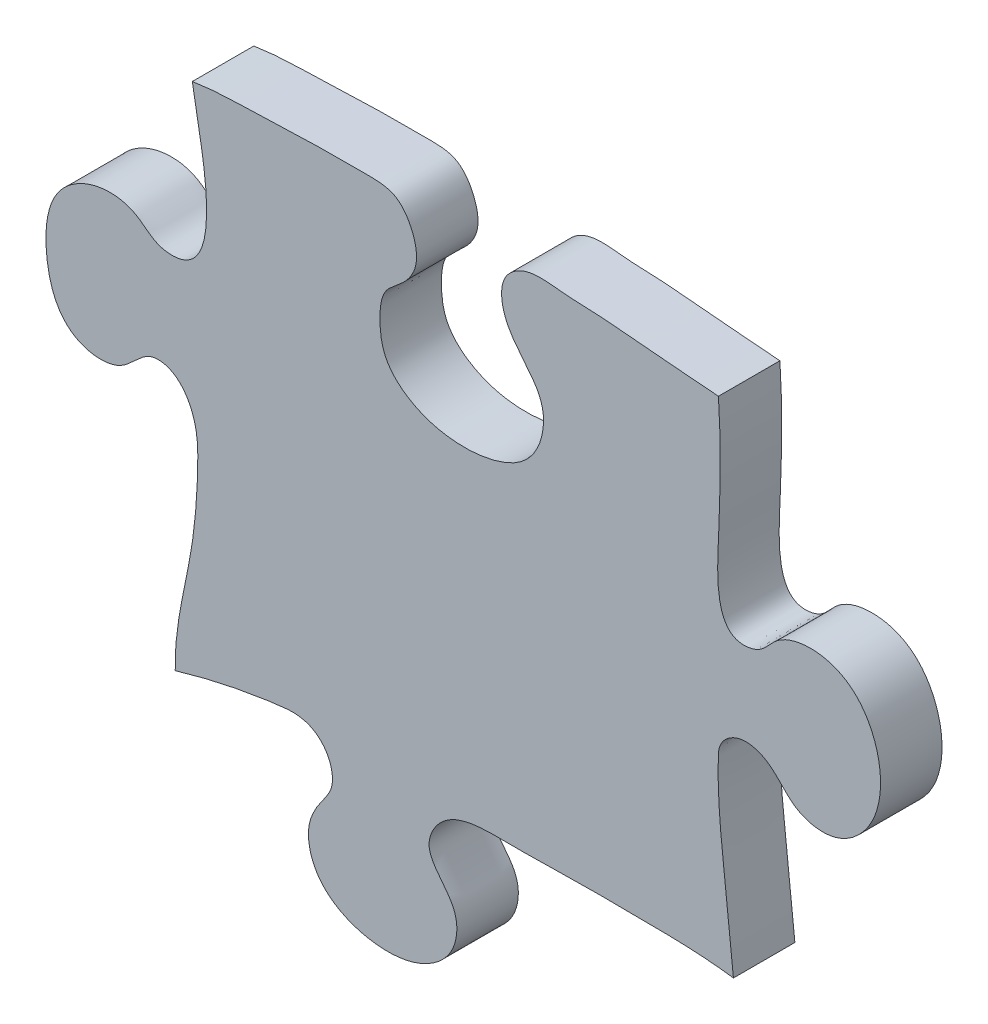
ISO-10303-21;
HEADER;
FILE_DESCRIPTION(('STEP AP214'),'2;1');
FILE_NAME('part.step','',(''),(''),'','','');
FILE_SCHEMA(('AUTOMOTIVE_DESIGN { 1 0 10303 214 1 1 1 1 }'));
ENDSEC;
DATA;
#1=APPLICATION_CONTEXT('core data for automotive mechanical design processes');
#2=APPLICATION_PROTOCOL_DEFINITION('international standard','automotive_design',2000,#1);
#3=PRODUCT_CONTEXT('',#1,'mechanical');
#4=PRODUCT('Part','Part','',(#3));
#5=PRODUCT_RELATED_PRODUCT_CATEGORY('part','',(#4));
#6=PRODUCT_DEFINITION_FORMATION('','',#4);
#7=PRODUCT_DEFINITION_CONTEXT('part definition',#1,'design');
#8=PRODUCT_DEFINITION('design','',#6,#7);
#9=PRODUCT_DEFINITION_SHAPE('','',#8);
#10=(LENGTH_UNIT() NAMED_UNIT(*) SI_UNIT(.MILLI.,.METRE.));
#11=(NAMED_UNIT(*) PLANE_ANGLE_UNIT() SI_UNIT($,.RADIAN.));
#12=(NAMED_UNIT(*) SI_UNIT($,.STERADIAN.) SOLID_ANGLE_UNIT());
#13=UNCERTAINTY_MEASURE_WITH_UNIT(LENGTH_MEASURE(1.E-05),#10,'distance_accuracy_value','');
#14=(GEOMETRIC_REPRESENTATION_CONTEXT(3) GLOBAL_UNCERTAINTY_ASSIGNED_CONTEXT((#13)) GLOBAL_UNIT_ASSIGNED_CONTEXT((#10,
#11,#12)) REPRESENTATION_CONTEXT('',''));
#15=CARTESIAN_POINT('',(0.,0.,0.));
#16=DIRECTION('',(0.,0.,1.));
#17=DIRECTION('',(1.,0.,0.));
#18=AXIS2_PLACEMENT_3D('',#15,#16,#17);
#19=CARTESIAN_POINT('',(164.700455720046,356.,-0.00999999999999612));
#20=CARTESIAN_POINT('',(166.684488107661,335.198470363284,-0.00999999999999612));
#21=CARTESIAN_POINT('',(165.501961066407,316.54844325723,-0.00999999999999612));
#22=CARTESIAN_POINT('',(164.960386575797,287.97241381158,-0.00999999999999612));
#23=CARTESIAN_POINT('',(152.647306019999,285.390744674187,-0.00999999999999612));
#24=CARTESIAN_POINT('',(146.755099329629,295.454986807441,-0.00999999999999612));
#25=CARTESIAN_POINT('',(133.057911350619,298.241097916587,-0.00999999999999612));
#26=CARTESIAN_POINT('',(118.543117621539,289.096389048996,-0.00999999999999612));
#27=CARTESIAN_POINT('',(110.066069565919,270.786201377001,-0.00999999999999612));
#28=CARTESIAN_POINT('',(115.81886117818,249.01949577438,-0.00999999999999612));
#29=CARTESIAN_POINT('',(132.43055469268,243.861484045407,-0.00999999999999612));
#30=CARTESIAN_POINT('',(145.190771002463,247.721589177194,-0.00999999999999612));
#31=CARTESIAN_POINT('',(150.073688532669,259.755128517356,-0.00999999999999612));
#32=CARTESIAN_POINT('',(164.873456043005,258.011209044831,-0.00999999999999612));
#33=CARTESIAN_POINT('',(166.852874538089,244.914449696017,-0.00999999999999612));
#34=CARTESIAN_POINT('',(165.64887314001,235.496089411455,-0.00999999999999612));
#35=CARTESIAN_POINT('',(164.287273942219,218.693357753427,-0.00999999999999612));
#36=CARTESIAN_POINT('',(162.190296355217,197.368034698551,-0.00999999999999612));
#37=CARTESIAN_POINT('',(156.3242571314,163.987545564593,-0.00999999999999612));
#38=CARTESIAN_POINT('',(154.411282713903,133.17643128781,-0.00999999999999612));
#39=CARTESIAN_POINT('',(156.534624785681,107.79955112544,-0.00999999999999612));
#40=CARTESIAN_POINT('',(165.683431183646,96.7362595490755,-0.00999999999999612));
#41=CARTESIAN_POINT('',(175.741034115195,97.7165246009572,-0.00999999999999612));
#42=CARTESIAN_POINT('',(178.913476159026,105.433342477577,-0.00999999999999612));
#43=CARTESIAN_POINT('',(187.788546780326,107.088038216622,-0.00999999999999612));
#44=CARTESIAN_POINT('',(196.945345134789,104.662624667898,-0.00999999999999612));
#45=CARTESIAN_POINT('',(205.29981235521,92.5405980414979,-0.00999999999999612));
#46=CARTESIAN_POINT('',(205.41693478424,76.2178133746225,-0.00999999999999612));
#47=CARTESIAN_POINT('',(199.239540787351,59.8870096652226,-0.00999999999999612));
#48=CARTESIAN_POINT('',(186.871281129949,54.774238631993,-0.00999999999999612));
#49=CARTESIAN_POINT('',(176.156697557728,56.844920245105,-0.00999999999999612));
#50=CARTESIAN_POINT('',(170.099360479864,65.2771221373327,-0.00999999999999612));
#51=CARTESIAN_POINT('',(157.970826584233,62.7514417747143,-0.00999999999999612));
#52=CARTESIAN_POINT('',(154.504441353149,46.6972732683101,-0.00999999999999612));
#53=CARTESIAN_POINT('',(156.826886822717,28.5222575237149,-0.00999999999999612));
#54=CARTESIAN_POINT('',(160.951813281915,-0.904965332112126,-0.00999999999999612));
#55=CARTESIAN_POINT('',(160.817443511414,-23.2712614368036,-0.00999999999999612));
#56=CARTESIAN_POINT('',(159.515162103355,-48.5242453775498,-0.00999999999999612));
#57=CARTESIAN_POINT('',(159.855435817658,-66.2012023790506,-0.00999999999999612));
#58=CARTESIAN_POINT('',(174.098925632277,-64.1326131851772,-0.00999999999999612));
#59=CARTESIAN_POINT('',(178.558905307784,-57.1982656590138,-0.00999999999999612));
#60=CARTESIAN_POINT('',(189.170801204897,-53.4758485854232,-0.00999999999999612));
#61=CARTESIAN_POINT('',(204.121791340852,-56.9229006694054,-0.00999999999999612));
#62=CARTESIAN_POINT('',(214.382314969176,-74.3254117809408,-0.00999999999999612));
#63=CARTESIAN_POINT('',(212.434433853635,-94.56819618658,-0.00999999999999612));
#64=CARTESIAN_POINT('',(198.400882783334,-105.927100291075,-0.00999999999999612));
#65=CARTESIAN_POINT('',(183.864051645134,-103.318484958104,-0.00999999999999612));
#66=CARTESIAN_POINT('',(177.484460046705,-92.9196706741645,-0.00999999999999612));
#67=CARTESIAN_POINT('',(166.612136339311,-90.3684772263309,-0.00999999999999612));
#68=CARTESIAN_POINT('',(160.072685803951,-95.573386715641,-0.00999999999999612));
#69=CARTESIAN_POINT('',(159.605088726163,-111.518801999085,-0.00999999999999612));
#70=CARTESIAN_POINT('',(161.971531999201,-132.152629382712,-0.00999999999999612));
#71=CARTESIAN_POINT('',(165.531009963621,-165.300059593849,-0.00999999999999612));
#72=CARTESIAN_POINT('',(167.927544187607,-195.365052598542,-0.00999999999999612));
#73=CARTESIAN_POINT('',(172.57489134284,-240.687787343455,-0.00999999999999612));
#74=CARTESIAN_POINT('',(151.998880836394,-237.677540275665,-0.00999999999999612));
#75=CARTESIAN_POINT('',(144.556929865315,-230.426442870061,-0.00999999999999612));
#76=CARTESIAN_POINT('',(127.822205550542,-229.966972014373,-0.00999999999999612));
#77=CARTESIAN_POINT('',(119.338975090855,-241.300441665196,-0.00999999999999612));
#78=CARTESIAN_POINT('',(116.55363668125,-259.024274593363,-0.00999999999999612));
#79=CARTESIAN_POINT('',(116.920126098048,-276.665079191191,-0.00999999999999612));
#80=CARTESIAN_POINT('',(139.807593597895,-286.808161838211,-0.00999999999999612));
#81=CARTESIAN_POINT('',(149.426451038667,-271.120437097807,-0.00999999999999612));
#82=CARTESIAN_POINT('',(164.833722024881,-276.098774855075,-0.00999999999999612));
#83=CARTESIAN_POINT('',(167.534498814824,-298.611176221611,-0.00999999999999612));
#84=CARTESIAN_POINT('',(167.66539945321,-324.44648435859,-0.00999999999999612));
#85=CARTESIAN_POINT('',(167.206886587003,-345.801767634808,-0.00999999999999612));
#86=CARTESIAN_POINT('',(167.126415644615,-356.,-0.00999999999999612));
#87=B_SPLINE_CURVE_WITH_KNOTS('',3,(#19,#20,#21,#22,#23,#24,#25,#26,#27,#28,#29,#30,#31,#32,#33,
#34,#35,#36,#37,#38,#39,#40,#41,#42,#43,#44,#45,#46,#47,#48,#49,#50,#51,#52,#53,#54,#55,#56,#57,
#58,#59,#60,#61,#62,#63,#64,#65,#66,#67,#68,#69,#70,#71,#72,#73,#74,#75,#76,#77,#78,#79,#80,#81,
#82,#83,#84,#85,#86),.UNSPECIFIED.,.F.,.F.,(4,1,1,1,1,1,1,1,1,1,1,1,1,1,1,1,1,1,1,1,1,1,1,1,1,1,
1,1,1,1,1,1,1,1,1,1,1,1,1,1,1,1,1,1,1,1,1,1,1,1,1,1,1,1,1,1,1,1,1,1,1,1,1,1,1,4),(0.,
0.0528861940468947,0.0611638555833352,0.0696733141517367,0.078438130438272,0.090018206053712,
0.103675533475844,0.122333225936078,0.142560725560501,0.155895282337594,0.165515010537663,
0.176439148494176,0.187171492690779,0.194785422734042,0.209132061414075,0.213814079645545,
0.241605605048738,0.267229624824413,0.306753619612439,0.326390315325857,0.335466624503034,
0.342457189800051,0.349640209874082,0.355564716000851,0.365339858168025,0.374043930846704,
0.393709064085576,0.408072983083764,0.418687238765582,0.427525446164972,0.43602306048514,
0.444515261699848,0.454494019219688,0.476412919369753,0.496275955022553,0.534624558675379,
0.541144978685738,0.561480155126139,0.567662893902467,0.574392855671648,0.583113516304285,
0.596680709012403,0.612912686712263,0.634082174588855,0.646626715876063,0.657822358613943,
0.669754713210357,0.678210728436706,0.685129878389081,0.689092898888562,0.71784093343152,
0.747115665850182,0.77522808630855,0.815611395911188,0.819725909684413,0.828398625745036,
0.84335213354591,0.85870373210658,0.863219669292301,0.888511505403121,0.901615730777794,
0.918667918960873,0.92637935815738,0.939283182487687,0.973955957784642,1.),.UNSPECIFIED.);
#88=DIRECTION('',(0.,0.,1.));
#89=VECTOR('',#88,1.);
#90=SURFACE_OF_LINEAR_EXTRUSION('',#87,#89);
#91=CARTESIAN_POINT('',(164.700455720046,356.,20.));
#92=CARTESIAN_POINT('',(166.684488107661,335.198470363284,20.));
#93=CARTESIAN_POINT('',(165.501961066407,316.54844325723,20.));
#94=CARTESIAN_POINT('',(164.960386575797,287.97241381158,20.));
#95=CARTESIAN_POINT('',(152.647306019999,285.390744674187,20.));
#96=CARTESIAN_POINT('',(146.755099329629,295.454986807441,20.));
#97=CARTESIAN_POINT('',(133.057911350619,298.241097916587,20.));
#98=CARTESIAN_POINT('',(118.543117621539,289.096389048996,20.));
#99=CARTESIAN_POINT('',(110.066069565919,270.786201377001,20.));
#100=CARTESIAN_POINT('',(115.81886117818,249.01949577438,20.));
#101=CARTESIAN_POINT('',(132.43055469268,243.861484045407,20.));
#102=CARTESIAN_POINT('',(145.190771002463,247.721589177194,20.));
#103=CARTESIAN_POINT('',(150.073688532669,259.755128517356,20.));
#104=CARTESIAN_POINT('',(164.873456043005,258.011209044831,20.));
#105=CARTESIAN_POINT('',(166.852874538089,244.914449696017,20.));
#106=CARTESIAN_POINT('',(165.64887314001,235.496089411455,20.));
#107=CARTESIAN_POINT('',(164.287273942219,218.693357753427,20.));
#108=CARTESIAN_POINT('',(162.190296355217,197.368034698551,20.));
#109=CARTESIAN_POINT('',(156.3242571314,163.987545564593,20.));
#110=CARTESIAN_POINT('',(154.411282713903,133.17643128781,20.));
#111=CARTESIAN_POINT('',(156.534624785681,107.79955112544,20.));
#112=CARTESIAN_POINT('',(165.683431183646,96.7362595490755,20.));
#113=CARTESIAN_POINT('',(175.741034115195,97.7165246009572,20.));
#114=CARTESIAN_POINT('',(178.913476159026,105.433342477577,20.));
#115=CARTESIAN_POINT('',(187.788546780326,107.088038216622,20.));
#116=CARTESIAN_POINT('',(196.945345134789,104.662624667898,20.));
#117=CARTESIAN_POINT('',(205.29981235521,92.5405980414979,20.));
#118=CARTESIAN_POINT('',(205.41693478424,76.2178133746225,20.));
#119=CARTESIAN_POINT('',(199.239540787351,59.8870096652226,20.));
#120=CARTESIAN_POINT('',(186.871281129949,54.774238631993,20.));
#121=CARTESIAN_POINT('',(176.156697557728,56.844920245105,20.));
#122=CARTESIAN_POINT('',(170.099360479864,65.2771221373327,20.));
#123=CARTESIAN_POINT('',(157.970826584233,62.7514417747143,20.));
#124=CARTESIAN_POINT('',(154.504441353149,46.6972732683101,20.));
#125=CARTESIAN_POINT('',(156.826886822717,28.5222575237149,20.));
#126=CARTESIAN_POINT('',(160.951813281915,-0.904965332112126,20.));
#127=CARTESIAN_POINT('',(160.817443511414,-23.2712614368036,20.));
#128=CARTESIAN_POINT('',(159.515162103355,-48.5242453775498,20.));
#129=CARTESIAN_POINT('',(159.855435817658,-66.2012023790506,20.));
#130=CARTESIAN_POINT('',(174.098925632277,-64.1326131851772,20.));
#131=CARTESIAN_POINT('',(178.558905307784,-57.1982656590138,20.));
#132=CARTESIAN_POINT('',(189.170801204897,-53.4758485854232,20.));
#133=CARTESIAN_POINT('',(204.121791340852,-56.9229006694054,20.));
#134=CARTESIAN_POINT('',(214.382314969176,-74.3254117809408,20.));
#135=CARTESIAN_POINT('',(212.434433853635,-94.56819618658,20.));
#136=CARTESIAN_POINT('',(198.400882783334,-105.927100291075,20.));
#137=CARTESIAN_POINT('',(183.864051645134,-103.318484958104,20.));
#138=CARTESIAN_POINT('',(177.484460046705,-92.9196706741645,20.));
#139=CARTESIAN_POINT('',(166.612136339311,-90.3684772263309,20.));
#140=CARTESIAN_POINT('',(160.072685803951,-95.573386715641,20.));
#141=CARTESIAN_POINT('',(159.605088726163,-111.518801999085,20.));
#142=CARTESIAN_POINT('',(161.971531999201,-132.152629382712,20.));
#143=CARTESIAN_POINT('',(165.531009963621,-165.300059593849,20.));
#144=CARTESIAN_POINT('',(167.927544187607,-195.365052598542,20.));
#145=CARTESIAN_POINT('',(172.57489134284,-240.687787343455,20.));
#146=CARTESIAN_POINT('',(151.998880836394,-237.677540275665,20.));
#147=CARTESIAN_POINT('',(144.556929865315,-230.426442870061,20.));
#148=CARTESIAN_POINT('',(127.822205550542,-229.966972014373,20.));
#149=CARTESIAN_POINT('',(119.338975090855,-241.300441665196,20.));
#150=CARTESIAN_POINT('',(116.55363668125,-259.024274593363,20.));
#151=CARTESIAN_POINT('',(116.920126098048,-276.665079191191,20.));
#152=CARTESIAN_POINT('',(139.807593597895,-286.808161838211,20.));
#153=CARTESIAN_POINT('',(149.426451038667,-271.120437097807,20.));
#154=CARTESIAN_POINT('',(164.833722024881,-276.098774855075,20.));
#155=CARTESIAN_POINT('',(167.534498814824,-298.611176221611,20.));
#156=CARTESIAN_POINT('',(167.66539945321,-324.44648435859,20.));
#157=CARTESIAN_POINT('',(167.206886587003,-345.801767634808,20.));
#158=CARTESIAN_POINT('',(167.126415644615,-356.,20.));
#159=B_SPLINE_CURVE_WITH_KNOTS('',3,(#91,#92,#93,#94,#95,#96,#97,#98,#99,#100,#101,#102,#103,
#104,#105,#106,#107,#108,#109,#110,#111,#112,#113,#114,#115,#116,#117,#118,#119,#120,#121,#122,
#123,#124,#125,#126,#127,#128,#129,#130,#131,#132,#133,#134,#135,#136,#137,#138,#139,#140,#141,
#142,#143,#144,#145,#146,#147,#148,#149,#150,#151,#152,#153,#154,#155,#156,#157,#158),
.UNSPECIFIED.,.F.,.F.,(4,1,1,1,1,1,1,1,1,1,1,1,1,1,1,1,1,1,1,1,1,1,1,1,1,1,1,1,1,1,1,1,1,1,1,1,
1,1,1,1,1,1,1,1,1,1,1,1,1,1,1,1,1,1,1,1,1,1,1,1,1,1,1,1,1,4),(0.,0.0528861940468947,
0.0611638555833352,0.0696733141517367,0.078438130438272,0.090018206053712,0.103675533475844,
0.122333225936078,0.142560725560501,0.155895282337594,0.165515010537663,0.176439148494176,
0.187171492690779,0.194785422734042,0.209132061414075,0.213814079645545,0.241605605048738,
0.267229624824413,0.306753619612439,0.326390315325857,0.335466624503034,0.342457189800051,
0.349640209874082,0.355564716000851,0.365339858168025,0.374043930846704,0.393709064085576,
0.408072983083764,0.418687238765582,0.427525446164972,0.43602306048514,0.444515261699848,
0.454494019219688,0.476412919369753,0.496275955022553,0.534624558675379,0.541144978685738,
0.561480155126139,0.567662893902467,0.574392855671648,0.583113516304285,0.596680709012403,
0.612912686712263,0.634082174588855,0.646626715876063,0.657822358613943,0.669754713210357,
0.678210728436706,0.685129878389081,0.689092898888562,0.71784093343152,0.747115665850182,
0.77522808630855,0.815611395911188,0.819725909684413,0.828398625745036,0.84335213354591,
0.85870373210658,0.863219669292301,0.888511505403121,0.901615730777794,0.918667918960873,
0.92637935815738,0.939283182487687,0.973955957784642,1.),.UNSPECIFIED.);
#160=CARTESIAN_POINT('',(160.020895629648,1.33334492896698,20.));
#161=VERTEX_POINT('',#160);
#162=CARTESIAN_POINT('',(164.89714626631,-160.138848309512,20.));
#163=VERTEX_POINT('',#162);
#164=EDGE_CURVE('E90',#161,#163,#159,.T.);
#165=ORIENTED_EDGE('',*,*,#164,.T.);
#166=DIRECTION('',(0.,0.,1.));
#167=VECTOR('',#166,1.);
#168=CARTESIAN_POINT('',(164.89714626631,-160.138848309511,-0.00999999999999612));
#169=LINE('',#168,#167);
#170=CARTESIAN_POINT('',(164.89714626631,-160.138848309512,0.));
#171=VERTEX_POINT('',#170);
#172=EDGE_CURVE('E80',#163,#171,#169,.F.);
#173=ORIENTED_EDGE('',*,*,#172,.T.);
#174=CARTESIAN_POINT('',(164.700455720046,356.,0.));
#175=CARTESIAN_POINT('',(166.684488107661,335.198470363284,0.));
#176=CARTESIAN_POINT('',(165.501961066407,316.54844325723,0.));
#177=CARTESIAN_POINT('',(164.960386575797,287.97241381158,0.));
#178=CARTESIAN_POINT('',(152.647306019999,285.390744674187,0.));
#179=CARTESIAN_POINT('',(146.755099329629,295.454986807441,0.));
#180=CARTESIAN_POINT('',(133.057911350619,298.241097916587,0.));
#181=CARTESIAN_POINT('',(118.543117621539,289.096389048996,0.));
#182=CARTESIAN_POINT('',(110.066069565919,270.786201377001,0.));
#183=CARTESIAN_POINT('',(115.81886117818,249.01949577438,0.));
#184=CARTESIAN_POINT('',(132.43055469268,243.861484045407,0.));
#185=CARTESIAN_POINT('',(145.190771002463,247.721589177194,0.));
#186=CARTESIAN_POINT('',(150.073688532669,259.755128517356,0.));
#187=CARTESIAN_POINT('',(164.873456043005,258.011209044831,0.));
#188=CARTESIAN_POINT('',(166.852874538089,244.914449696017,0.));
#189=CARTESIAN_POINT('',(165.64887314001,235.496089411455,0.));
#190=CARTESIAN_POINT('',(164.287273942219,218.693357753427,0.));
#191=CARTESIAN_POINT('',(162.190296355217,197.368034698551,0.));
#192=CARTESIAN_POINT('',(156.3242571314,163.987545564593,0.));
#193=CARTESIAN_POINT('',(154.411282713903,133.17643128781,0.));
#194=CARTESIAN_POINT('',(156.534624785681,107.79955112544,0.));
#195=CARTESIAN_POINT('',(165.683431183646,96.7362595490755,0.));
#196=CARTESIAN_POINT('',(175.741034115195,97.7165246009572,0.));
#197=CARTESIAN_POINT('',(178.913476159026,105.433342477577,0.));
#198=CARTESIAN_POINT('',(187.788546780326,107.088038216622,0.));
#199=CARTESIAN_POINT('',(196.945345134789,104.662624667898,0.));
#200=CARTESIAN_POINT('',(205.29981235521,92.5405980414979,0.));
#201=CARTESIAN_POINT('',(205.41693478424,76.2178133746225,0.));
#202=CARTESIAN_POINT('',(199.239540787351,59.8870096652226,0.));
#203=CARTESIAN_POINT('',(186.871281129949,54.774238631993,0.));
#204=CARTESIAN_POINT('',(176.156697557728,56.844920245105,0.));
#205=CARTESIAN_POINT('',(170.099360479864,65.2771221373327,0.));
#206=CARTESIAN_POINT('',(157.970826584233,62.7514417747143,0.));
#207=CARTESIAN_POINT('',(154.504441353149,46.6972732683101,0.));
#208=CARTESIAN_POINT('',(156.826886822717,28.5222575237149,0.));
#209=CARTESIAN_POINT('',(160.951813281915,-0.904965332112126,0.));
#210=CARTESIAN_POINT('',(160.817443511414,-23.2712614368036,0.));
#211=CARTESIAN_POINT('',(159.515162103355,-48.5242453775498,0.));
#212=CARTESIAN_POINT('',(159.855435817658,-66.2012023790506,0.));
#213=CARTESIAN_POINT('',(174.098925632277,-64.1326131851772,0.));
#214=CARTESIAN_POINT('',(178.558905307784,-57.1982656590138,0.));
#215=CARTESIAN_POINT('',(189.170801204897,-53.4758485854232,0.));
#216=CARTESIAN_POINT('',(204.121791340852,-56.9229006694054,0.));
#217=CARTESIAN_POINT('',(214.382314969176,-74.3254117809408,0.));
#218=CARTESIAN_POINT('',(212.434433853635,-94.56819618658,0.));
#219=CARTESIAN_POINT('',(198.400882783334,-105.927100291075,0.));
#220=CARTESIAN_POINT('',(183.864051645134,-103.318484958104,0.));
#221=CARTESIAN_POINT('',(177.484460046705,-92.9196706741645,0.));
#222=CARTESIAN_POINT('',(166.612136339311,-90.3684772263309,0.));
#223=CARTESIAN_POINT('',(160.072685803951,-95.573386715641,0.));
#224=CARTESIAN_POINT('',(159.605088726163,-111.518801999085,0.));
#225=CARTESIAN_POINT('',(161.971531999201,-132.152629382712,0.));
#226=CARTESIAN_POINT('',(165.531009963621,-165.300059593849,0.));
#227=CARTESIAN_POINT('',(167.927544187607,-195.365052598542,0.));
#228=CARTESIAN_POINT('',(172.57489134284,-240.687787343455,0.));
#229=CARTESIAN_POINT('',(151.998880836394,-237.677540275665,0.));
#230=CARTESIAN_POINT('',(144.556929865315,-230.426442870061,0.));
#231=CARTESIAN_POINT('',(127.822205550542,-229.966972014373,0.));
#232=CARTESIAN_POINT('',(119.338975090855,-241.300441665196,0.));
#233=CARTESIAN_POINT('',(116.55363668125,-259.024274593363,0.));
#234=CARTESIAN_POINT('',(116.920126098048,-276.665079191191,0.));
#235=CARTESIAN_POINT('',(139.807593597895,-286.808161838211,0.));
#236=CARTESIAN_POINT('',(149.426451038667,-271.120437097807,0.));
#237=CARTESIAN_POINT('',(164.833722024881,-276.098774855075,0.));
#238=CARTESIAN_POINT('',(167.534498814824,-298.611176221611,0.));
#239=CARTESIAN_POINT('',(167.66539945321,-324.44648435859,0.));
#240=CARTESIAN_POINT('',(167.206886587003,-345.801767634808,0.));
#241=CARTESIAN_POINT('',(167.126415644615,-356.,0.));
#242=B_SPLINE_CURVE_WITH_KNOTS('',3,(#174,#175,#176,#177,#178,#179,#180,#181,#182,#183,#184,
#185,#186,#187,#188,#189,#190,#191,#192,#193,#194,#195,#196,#197,#198,#199,#200,#201,#202,#203,
#204,#205,#206,#207,#208,#209,#210,#211,#212,#213,#214,#215,#216,#217,#218,#219,#220,#221,#222,
#223,#224,#225,#226,#227,#228,#229,#230,#231,#232,#233,#234,#235,#236,#237,#238,#239,#240,#241),
.UNSPECIFIED.,.F.,.F.,(4,1,1,1,1,1,1,1,1,1,1,1,1,1,1,1,1,1,1,1,1,1,1,1,1,1,1,1,1,1,1,1,1,1,1,1,
1,1,1,1,1,1,1,1,1,1,1,1,1,1,1,1,1,1,1,1,1,1,1,1,1,1,1,1,1,4),(0.,0.0528861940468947,
0.0611638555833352,0.0696733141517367,0.078438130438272,0.090018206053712,0.103675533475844,
0.122333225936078,0.142560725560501,0.155895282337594,0.165515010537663,0.176439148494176,
0.187171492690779,0.194785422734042,0.209132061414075,0.213814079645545,0.241605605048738,
0.267229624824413,0.306753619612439,0.326390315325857,0.335466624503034,0.342457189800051,
0.349640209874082,0.355564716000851,0.365339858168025,0.374043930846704,0.393709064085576,
0.408072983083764,0.418687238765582,0.427525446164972,0.43602306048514,0.444515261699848,
0.454494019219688,0.476412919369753,0.496275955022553,0.534624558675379,0.541144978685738,
0.561480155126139,0.567662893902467,0.574392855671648,0.583113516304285,0.596680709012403,
0.612912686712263,0.634082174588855,0.646626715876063,0.657822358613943,0.669754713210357,
0.678210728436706,0.685129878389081,0.689092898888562,0.71784093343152,0.747115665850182,
0.77522808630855,0.815611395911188,0.819725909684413,0.828398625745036,0.84335213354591,
0.85870373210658,0.863219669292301,0.888511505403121,0.901615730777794,0.918667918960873,
0.92637935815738,0.939283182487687,0.973955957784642,1.),.UNSPECIFIED.);
#243=CARTESIAN_POINT('',(160.020895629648,1.33334492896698,0.));
#244=VERTEX_POINT('',#243);
#245=EDGE_CURVE('E122',#244,#171,#242,.T.);
#246=ORIENTED_EDGE('',*,*,#245,.F.);
#247=DIRECTION('',(0.,0.,1.));
#248=VECTOR('',#247,1.);
#249=CARTESIAN_POINT('',(160.020895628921,1.33334492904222,-0.00999999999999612));
#250=LINE('',#249,#248);
#251=EDGE_CURVE('E91',#161,#244,#250,.F.);
#252=ORIENTED_EDGE('',*,*,#251,.F.);
#253=EDGE_LOOP('',(#165,#173,#246,#252));
#254=FACE_BOUND('',#253,.T.);
#255=ADVANCED_FACE('F34',(#254),#90,.F.);
#256=CARTESIAN_POINT('',(-9.39078729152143,356.,-0.00999999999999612));
#257=CARTESIAN_POINT('',(-10.6420004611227,342.109118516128,-0.00999999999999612));
#258=CARTESIAN_POINT('',(-14.6613121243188,319.56927935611,-0.00999999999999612));
#259=CARTESIAN_POINT('',(-17.4473947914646,293.08555207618,-0.00999999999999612));
#260=CARTESIAN_POINT('',(-13.8884373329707,273.667988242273,-0.00999999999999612));
#261=CARTESIAN_POINT('',(-1.07625820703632,271.397705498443,-0.00999999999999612));
#262=CARTESIAN_POINT('',(5.29309239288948,278.450722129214,-0.00999999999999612));
#263=CARTESIAN_POINT('',(14.9258759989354,283.741247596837,-0.00999999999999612));
#264=CARTESIAN_POINT('',(28.790892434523,278.335723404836,-0.00999999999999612));
#265=CARTESIAN_POINT('',(34.7382562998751,261.206713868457,-0.00999999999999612));
#266=CARTESIAN_POINT('',(33.1132905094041,240.122633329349,-0.00999999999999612));
#267=CARTESIAN_POINT('',(14.6676977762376,229.968331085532,-0.00999999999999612));
#268=CARTESIAN_POINT('',(3.42611827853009,235.442407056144,-0.00999999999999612));
#269=CARTESIAN_POINT('',(-2.96249564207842,240.393740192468,-0.00999999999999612));
#270=CARTESIAN_POINT('',(-18.0780076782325,240.138784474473,-0.00999999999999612));
#271=CARTESIAN_POINT('',(-18.5399667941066,222.992463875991,-0.00999999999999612));
#272=CARTESIAN_POINT('',(-17.4385931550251,202.827665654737,-0.00999999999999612));
#273=CARTESIAN_POINT('',(-14.0858554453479,190.221137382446,-0.00999999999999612));
#274=CARTESIAN_POINT('',(-15.5193743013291,175.136568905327,-0.00999999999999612));
#275=CARTESIAN_POINT('',(-16.6888175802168,157.648124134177,-0.00999999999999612));
#276=CARTESIAN_POINT('',(-17.7707660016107,144.240131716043,-0.00999999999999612));
#277=CARTESIAN_POINT('',(-17.3940925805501,124.109890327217,-0.00999999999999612));
#278=CARTESIAN_POINT('',(-18.6861496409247,110.985540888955,-0.00999999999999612));
#279=CARTESIAN_POINT('',(-3.94695866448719,101.126063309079,-0.00999999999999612));
#280=CARTESIAN_POINT('',(4.50824278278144,111.148466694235,-0.00999999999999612));
#281=CARTESIAN_POINT('',(13.1578407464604,120.870763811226,-0.00999999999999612));
#282=CARTESIAN_POINT('',(29.968112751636,122.314288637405,-0.00999999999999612));
#283=CARTESIAN_POINT('',(40.7223803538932,110.783826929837,-0.00999999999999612));
#284=CARTESIAN_POINT('',(45.7909417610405,94.3968136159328,-0.00999999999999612));
#285=CARTESIAN_POINT('',(43.9390810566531,75.8787758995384,-0.00999999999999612));
#286=CARTESIAN_POINT('',(30.503103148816,62.5847389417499,-0.00999999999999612));
#287=CARTESIAN_POINT('',(14.6986660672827,64.8647821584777,-0.00999999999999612));
#288=CARTESIAN_POINT('',(6.48631275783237,74.2887035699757,-0.00999999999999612));
#289=CARTESIAN_POINT('',(-2.74495882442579,80.3019272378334,-0.00999999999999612));
#290=CARTESIAN_POINT('',(-19.8840521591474,73.8019115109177,-0.00999999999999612));
#291=CARTESIAN_POINT('',(-15.1166354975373,44.269693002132,-0.00999999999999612));
#292=CARTESIAN_POINT('',(-13.5094217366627,17.7920418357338,-0.00999999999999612));
#293=CARTESIAN_POINT('',(-10.2430798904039,-1.06342782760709,-0.00999999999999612));
#294=CARTESIAN_POINT('',(-6.15123504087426,-23.5391381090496,-0.00999999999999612));
#295=CARTESIAN_POINT('',(-4.12992604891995,-48.8436757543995,-0.00999999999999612));
#296=CARTESIAN_POINT('',(-23.2142462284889,-47.7574601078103,-0.00999999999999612));
#297=CARTESIAN_POINT('',(-30.0018234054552,-40.5423137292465,-0.00999999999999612));
#298=CARTESIAN_POINT('',(-42.7528213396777,-39.1853410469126,-0.00999999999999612));
#299=CARTESIAN_POINT('',(-57.5092962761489,-47.8418744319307,-0.00999999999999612));
#300=CARTESIAN_POINT('',(-60.2210733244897,-67.5138769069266,-0.00999999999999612));
#301=CARTESIAN_POINT('',(-54.0018378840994,-88.1567638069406,-0.00999999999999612));
#302=CARTESIAN_POINT('',(-33.5101255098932,-90.2818581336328,-0.00999999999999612));
#303=CARTESIAN_POINT('',(-26.938266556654,-78.8436195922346,-0.00999999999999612));
#304=CARTESIAN_POINT('',(-16.0575989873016,-79.9605650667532,-0.00999999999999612));
#305=CARTESIAN_POINT('',(-9.29054500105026,-89.9843542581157,-0.00999999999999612));
#306=CARTESIAN_POINT('',(-9.26037942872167,-106.547726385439,-0.00999999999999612));
#307=CARTESIAN_POINT('',(-10.8655976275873,-129.908253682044,-0.00999999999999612));
#308=CARTESIAN_POINT('',(-18.080355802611,-155.05589418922,-0.00999999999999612));
#309=CARTESIAN_POINT('',(-15.5015350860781,-180.564325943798,-0.00999999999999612));
#310=CARTESIAN_POINT('',(-13.4534563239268,-202.72625863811,-0.00999999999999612));
#311=CARTESIAN_POINT('',(-13.0721771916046,-222.761537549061,-0.00999999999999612));
#312=CARTESIAN_POINT('',(-18.0801009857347,-237.162246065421,-0.00999999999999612));
#313=CARTESIAN_POINT('',(-28.3640065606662,-243.264641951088,-0.00999999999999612));
#314=CARTESIAN_POINT('',(-35.3195309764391,-234.565632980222,-0.00999999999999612));
#315=CARTESIAN_POINT('',(-45.5220607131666,-230.442721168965,-0.00999999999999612));
#316=CARTESIAN_POINT('',(-58.2826152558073,-236.227844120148,-0.00999999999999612));
#317=CARTESIAN_POINT('',(-63.2505187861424,-252.690663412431,-0.00999999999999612));
#318=CARTESIAN_POINT('',(-62.4331763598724,-269.758175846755,-0.00999999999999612));
#319=CARTESIAN_POINT('',(-51.5712190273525,-281.475483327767,-0.00999999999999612));
#320=CARTESIAN_POINT('',(-36.6120763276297,-283.519302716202,-0.00999999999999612));
#321=CARTESIAN_POINT('',(-27.825780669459,-270.933950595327,-0.00999999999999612));
#322=CARTESIAN_POINT('',(-10.9923291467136,-277.705324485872,-0.00999999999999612));
#323=CARTESIAN_POINT('',(-14.9884890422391,-312.557066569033,-0.00999999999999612));
#324=CARTESIAN_POINT('',(-14.8626828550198,-333.640060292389,-0.00999999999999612));
#325=CARTESIAN_POINT('',(-17.0261941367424,-356.,-0.00999999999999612));
#326=B_SPLINE_CURVE_WITH_KNOTS('',3,(#256,#257,#258,#259,#260,#261,#262,#263,#264,#265,#266,
#267,#268,#269,#270,#271,#272,#273,#274,#275,#276,#277,#278,#279,#280,#281,#282,#283,#284,#285,
#286,#287,#288,#289,#290,#291,#292,#293,#294,#295,#296,#297,#298,#299,#300,#301,#302,#303,#304,
#305,#306,#307,#308,#309,#310,#311,#312,#313,#314,#315,#316,#317,#318,#319,#320,#321,#322,#323,
#324,#325),.UNSPECIFIED.,.F.,.F.,(4,1,1,1,1,1,1,1,1,1,1,1,1,1,1,1,1,1,1,1,1,1,1,1,1,1,1,1,1,1,1,
1,1,1,1,1,1,1,1,1,1,1,1,1,1,1,1,1,1,1,1,1,1,1,1,1,1,1,1,1,1,1,1,1,1,1,1,4),(0.,
0.0382435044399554,0.06014267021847,0.0759154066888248,0.0830880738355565,0.0898528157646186,
0.100420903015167,0.110971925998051,0.125303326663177,0.146622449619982,0.16313068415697,
0.171984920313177,0.178976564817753,0.184846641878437,0.208558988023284,0.213294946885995,
0.232206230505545,0.247690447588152,0.25282597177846,0.280146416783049,0.285652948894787,
0.304476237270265,0.313783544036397,0.32377706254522,0.334253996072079,0.350240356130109,
0.361652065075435,0.37428972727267,0.396319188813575,0.408299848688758,0.421251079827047,
0.43387737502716,0.442611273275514,0.448402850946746,0.478919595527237,0.50340807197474,
0.525599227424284,0.531488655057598,0.562302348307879,0.569309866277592,0.576593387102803,
0.588291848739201,0.600948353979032,0.618957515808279,0.638096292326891,0.652011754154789,
0.663601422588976,0.667955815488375,0.679319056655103,0.692000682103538,0.712742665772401,
0.742765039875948,0.761777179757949,0.781638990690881,0.803327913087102,0.815753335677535,
0.82139602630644,0.831491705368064,0.840302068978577,0.85029925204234,0.865053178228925,
0.884091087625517,0.893653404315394,0.906570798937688,0.918850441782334,0.928550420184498,
0.945628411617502,1.),.UNSPECIFIED.);
#327=DIRECTION('',(0.,0.,1.));
#328=VECTOR('',#327,1.);
#329=SURFACE_OF_LINEAR_EXTRUSION('',#326,#328);
#330=CARTESIAN_POINT('',(-9.39078729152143,356.,20.));
#331=CARTESIAN_POINT('',(-10.6420004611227,342.109118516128,20.));
#332=CARTESIAN_POINT('',(-14.6613121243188,319.56927935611,20.));
#333=CARTESIAN_POINT('',(-17.4473947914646,293.08555207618,20.));
#334=CARTESIAN_POINT('',(-13.8884373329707,273.667988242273,20.));
#335=CARTESIAN_POINT('',(-1.07625820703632,271.397705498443,20.));
#336=CARTESIAN_POINT('',(5.29309239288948,278.450722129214,20.));
#337=CARTESIAN_POINT('',(14.9258759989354,283.741247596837,20.));
#338=CARTESIAN_POINT('',(28.790892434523,278.335723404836,20.));
#339=CARTESIAN_POINT('',(34.7382562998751,261.206713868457,20.));
#340=CARTESIAN_POINT('',(33.1132905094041,240.122633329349,20.));
#341=CARTESIAN_POINT('',(14.6676977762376,229.968331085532,20.));
#342=CARTESIAN_POINT('',(3.42611827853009,235.442407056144,20.));
#343=CARTESIAN_POINT('',(-2.96249564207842,240.393740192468,20.));
#344=CARTESIAN_POINT('',(-18.0780076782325,240.138784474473,20.));
#345=CARTESIAN_POINT('',(-18.5399667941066,222.992463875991,20.));
#346=CARTESIAN_POINT('',(-17.4385931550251,202.827665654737,20.));
#347=CARTESIAN_POINT('',(-14.0858554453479,190.221137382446,20.));
#348=CARTESIAN_POINT('',(-15.5193743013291,175.136568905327,20.));
#349=CARTESIAN_POINT('',(-16.6888175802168,157.648124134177,20.));
#350=CARTESIAN_POINT('',(-17.7707660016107,144.240131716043,20.));
#351=CARTESIAN_POINT('',(-17.3940925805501,124.109890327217,20.));
#352=CARTESIAN_POINT('',(-18.6861496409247,110.985540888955,20.));
#353=CARTESIAN_POINT('',(-3.94695866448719,101.126063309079,20.));
#354=CARTESIAN_POINT('',(4.50824278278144,111.148466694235,20.));
#355=CARTESIAN_POINT('',(13.1578407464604,120.870763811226,20.));
#356=CARTESIAN_POINT('',(29.968112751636,122.314288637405,20.));
#357=CARTESIAN_POINT('',(40.7223803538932,110.783826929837,20.));
#358=CARTESIAN_POINT('',(45.7909417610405,94.3968136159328,20.));
#359=CARTESIAN_POINT('',(43.9390810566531,75.8787758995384,20.));
#360=CARTESIAN_POINT('',(30.503103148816,62.5847389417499,20.));
#361=CARTESIAN_POINT('',(14.6986660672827,64.8647821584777,20.));
#362=CARTESIAN_POINT('',(6.48631275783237,74.2887035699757,20.));
#363=CARTESIAN_POINT('',(-2.74495882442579,80.3019272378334,20.));
#364=CARTESIAN_POINT('',(-19.8840521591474,73.8019115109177,20.));
#365=CARTESIAN_POINT('',(-15.1166354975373,44.269693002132,20.));
#366=CARTESIAN_POINT('',(-13.5094217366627,17.7920418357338,20.));
#367=CARTESIAN_POINT('',(-10.2430798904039,-1.06342782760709,20.));
#368=CARTESIAN_POINT('',(-6.15123504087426,-23.5391381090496,20.));
#369=CARTESIAN_POINT('',(-4.12992604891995,-48.8436757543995,20.));
#370=CARTESIAN_POINT('',(-23.2142462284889,-47.7574601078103,20.));
#371=CARTESIAN_POINT('',(-30.0018234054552,-40.5423137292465,20.));
#372=CARTESIAN_POINT('',(-42.7528213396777,-39.1853410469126,20.));
#373=CARTESIAN_POINT('',(-57.5092962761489,-47.8418744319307,20.));
#374=CARTESIAN_POINT('',(-60.2210733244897,-67.5138769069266,20.));
#375=CARTESIAN_POINT('',(-54.0018378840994,-88.1567638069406,20.));
#376=CARTESIAN_POINT('',(-33.5101255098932,-90.2818581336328,20.));
#377=CARTESIAN_POINT('',(-26.938266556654,-78.8436195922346,20.));
#378=CARTESIAN_POINT('',(-16.0575989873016,-79.9605650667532,20.));
#379=CARTESIAN_POINT('',(-9.29054500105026,-89.9843542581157,20.));
#380=CARTESIAN_POINT('',(-9.26037942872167,-106.547726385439,20.));
#381=CARTESIAN_POINT('',(-10.8655976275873,-129.908253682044,20.));
#382=CARTESIAN_POINT('',(-18.080355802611,-155.05589418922,20.));
#383=CARTESIAN_POINT('',(-15.5015350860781,-180.564325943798,20.));
#384=CARTESIAN_POINT('',(-13.4534563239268,-202.72625863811,20.));
#385=CARTESIAN_POINT('',(-13.0721771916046,-222.761537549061,20.));
#386=CARTESIAN_POINT('',(-18.0801009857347,-237.162246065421,20.));
#387=CARTESIAN_POINT('',(-28.3640065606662,-243.264641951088,20.));
#388=CARTESIAN_POINT('',(-35.3195309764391,-234.565632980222,20.));
#389=CARTESIAN_POINT('',(-45.5220607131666,-230.442721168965,20.));
#390=CARTESIAN_POINT('',(-58.2826152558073,-236.227844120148,20.));
#391=CARTESIAN_POINT('',(-63.2505187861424,-252.690663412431,20.));
#392=CARTESIAN_POINT('',(-62.4331763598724,-269.758175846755,20.));
#393=CARTESIAN_POINT('',(-51.5712190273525,-281.475483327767,20.));
#394=CARTESIAN_POINT('',(-36.6120763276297,-283.519302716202,20.));
#395=CARTESIAN_POINT('',(-27.825780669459,-270.933950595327,20.));
#396=CARTESIAN_POINT('',(-10.9923291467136,-277.705324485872,20.));
#397=CARTESIAN_POINT('',(-14.9884890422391,-312.557066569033,20.));
#398=CARTESIAN_POINT('',(-14.8626828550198,-333.640060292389,20.));
#399=CARTESIAN_POINT('',(-17.0261941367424,-356.,20.));
#400=B_SPLINE_CURVE_WITH_KNOTS('',3,(#330,#331,#332,#333,#334,#335,#336,#337,#338,#339,#340,
#341,#342,#343,#344,#345,#346,#347,#348,#349,#350,#351,#352,#353,#354,#355,#356,#357,#358,#359,
#360,#361,#362,#363,#364,#365,#366,#367,#368,#369,#370,#371,#372,#373,#374,#375,#376,#377,#378,
#379,#380,#381,#382,#383,#384,#385,#386,#387,#388,#389,#390,#391,#392,#393,#394,#395,#396,#397,
#398,#399),.UNSPECIFIED.,.F.,.F.,(4,1,1,1,1,1,1,1,1,1,1,1,1,1,1,1,1,1,1,1,1,1,1,1,1,1,1,1,1,1,1,
1,1,1,1,1,1,1,1,1,1,1,1,1,1,1,1,1,1,1,1,1,1,1,1,1,1,1,1,1,1,1,1,1,1,1,1,4),(0.,
0.0382435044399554,0.06014267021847,0.0759154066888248,0.0830880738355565,0.0898528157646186,
0.100420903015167,0.110971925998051,0.125303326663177,0.146622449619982,0.16313068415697,
0.171984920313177,0.178976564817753,0.184846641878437,0.208558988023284,0.213294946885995,
0.232206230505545,0.247690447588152,0.25282597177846,0.280146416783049,0.285652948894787,
0.304476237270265,0.313783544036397,0.32377706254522,0.334253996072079,0.350240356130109,
0.361652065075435,0.37428972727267,0.396319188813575,0.408299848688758,0.421251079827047,
0.43387737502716,0.442611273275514,0.448402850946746,0.478919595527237,0.50340807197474,
0.525599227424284,0.531488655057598,0.562302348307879,0.569309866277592,0.576593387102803,
0.588291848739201,0.600948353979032,0.618957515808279,0.638096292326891,0.652011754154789,
0.663601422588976,0.667955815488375,0.679319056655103,0.692000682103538,0.712742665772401,
0.742765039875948,0.761777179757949,0.781638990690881,0.803327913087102,0.815753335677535,
0.82139602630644,0.831491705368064,0.840302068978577,0.85029925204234,0.865053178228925,
0.884091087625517,0.893653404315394,0.906570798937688,0.918850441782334,0.928550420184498,
0.945628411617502,1.),.UNSPECIFIED.);
#401=CARTESIAN_POINT('',(-11.1415971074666,4.42864181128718,20.));
#402=VERTEX_POINT('',#401);
#403=CARTESIAN_POINT('',(-16.6986782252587,-164.35007147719,20.));
#404=VERTEX_POINT('',#403);
#405=EDGE_CURVE('E53',#402,#404,#400,.T.);
#406=ORIENTED_EDGE('',*,*,#405,.F.);
#407=DIRECTION('',(0.,0.,1.));
#408=VECTOR('',#407,1.);
#409=CARTESIAN_POINT('',(-11.1415971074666,4.42864181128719,-0.00999999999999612));
#410=LINE('',#409,#408);
#411=CARTESIAN_POINT('',(-11.1415971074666,4.42864181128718,0.));
#412=VERTEX_POINT('',#411);
#413=EDGE_CURVE('E87',#402,#412,#410,.F.);
#414=ORIENTED_EDGE('',*,*,#413,.T.);
#415=CARTESIAN_POINT('',(-9.39078729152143,356.,0.));
#416=CARTESIAN_POINT('',(-10.6420004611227,342.109118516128,0.));
#417=CARTESIAN_POINT('',(-14.6613121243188,319.56927935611,0.));
#418=CARTESIAN_POINT('',(-17.4473947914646,293.08555207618,0.));
#419=CARTESIAN_POINT('',(-13.8884373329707,273.667988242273,0.));
#420=CARTESIAN_POINT('',(-1.07625820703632,271.397705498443,0.));
#421=CARTESIAN_POINT('',(5.29309239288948,278.450722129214,0.));
#422=CARTESIAN_POINT('',(14.9258759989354,283.741247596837,0.));
#423=CARTESIAN_POINT('',(28.790892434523,278.335723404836,0.));
#424=CARTESIAN_POINT('',(34.7382562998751,261.206713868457,0.));
#425=CARTESIAN_POINT('',(33.1132905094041,240.122633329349,0.));
#426=CARTESIAN_POINT('',(14.6676977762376,229.968331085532,0.));
#427=CARTESIAN_POINT('',(3.42611827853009,235.442407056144,0.));
#428=CARTESIAN_POINT('',(-2.96249564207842,240.393740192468,0.));
#429=CARTESIAN_POINT('',(-18.0780076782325,240.138784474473,0.));
#430=CARTESIAN_POINT('',(-18.5399667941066,222.992463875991,0.));
#431=CARTESIAN_POINT('',(-17.4385931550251,202.827665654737,0.));
#432=CARTESIAN_POINT('',(-14.0858554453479,190.221137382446,0.));
#433=CARTESIAN_POINT('',(-15.5193743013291,175.136568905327,0.));
#434=CARTESIAN_POINT('',(-16.6888175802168,157.648124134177,0.));
#435=CARTESIAN_POINT('',(-17.7707660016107,144.240131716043,0.));
#436=CARTESIAN_POINT('',(-17.3940925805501,124.109890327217,0.));
#437=CARTESIAN_POINT('',(-18.6861496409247,110.985540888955,0.));
#438=CARTESIAN_POINT('',(-3.94695866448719,101.126063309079,0.));
#439=CARTESIAN_POINT('',(4.50824278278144,111.148466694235,0.));
#440=CARTESIAN_POINT('',(13.1578407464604,120.870763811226,0.));
#441=CARTESIAN_POINT('',(29.968112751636,122.314288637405,0.));
#442=CARTESIAN_POINT('',(40.7223803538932,110.783826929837,0.));
#443=CARTESIAN_POINT('',(45.7909417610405,94.3968136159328,0.));
#444=CARTESIAN_POINT('',(43.9390810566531,75.8787758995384,0.));
#445=CARTESIAN_POINT('',(30.503103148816,62.5847389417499,0.));
#446=CARTESIAN_POINT('',(14.6986660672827,64.8647821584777,0.));
#447=CARTESIAN_POINT('',(6.48631275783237,74.2887035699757,0.));
#448=CARTESIAN_POINT('',(-2.74495882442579,80.3019272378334,0.));
#449=CARTESIAN_POINT('',(-19.8840521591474,73.8019115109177,0.));
#450=CARTESIAN_POINT('',(-15.1166354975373,44.269693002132,0.));
#451=CARTESIAN_POINT('',(-13.5094217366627,17.7920418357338,0.));
#452=CARTESIAN_POINT('',(-10.2430798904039,-1.06342782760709,0.));
#453=CARTESIAN_POINT('',(-6.15123504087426,-23.5391381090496,0.));
#454=CARTESIAN_POINT('',(-4.12992604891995,-48.8436757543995,0.));
#455=CARTESIAN_POINT('',(-23.2142462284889,-47.7574601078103,0.));
#456=CARTESIAN_POINT('',(-30.0018234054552,-40.5423137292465,0.));
#457=CARTESIAN_POINT('',(-42.7528213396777,-39.1853410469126,0.));
#458=CARTESIAN_POINT('',(-57.5092962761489,-47.8418744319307,0.));
#459=CARTESIAN_POINT('',(-60.2210733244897,-67.5138769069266,0.));
#460=CARTESIAN_POINT('',(-54.0018378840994,-88.1567638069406,0.));
#461=CARTESIAN_POINT('',(-33.5101255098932,-90.2818581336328,0.));
#462=CARTESIAN_POINT('',(-26.938266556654,-78.8436195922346,0.));
#463=CARTESIAN_POINT('',(-16.0575989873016,-79.9605650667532,0.));
#464=CARTESIAN_POINT('',(-9.29054500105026,-89.9843542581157,0.));
#465=CARTESIAN_POINT('',(-9.26037942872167,-106.547726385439,0.));
#466=CARTESIAN_POINT('',(-10.8655976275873,-129.908253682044,0.));
#467=CARTESIAN_POINT('',(-18.080355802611,-155.05589418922,0.));
#468=CARTESIAN_POINT('',(-15.5015350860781,-180.564325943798,0.));
#469=CARTESIAN_POINT('',(-13.4534563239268,-202.72625863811,0.));
#470=CARTESIAN_POINT('',(-13.0721771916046,-222.761537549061,0.));
#471=CARTESIAN_POINT('',(-18.0801009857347,-237.162246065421,0.));
#472=CARTESIAN_POINT('',(-28.3640065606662,-243.264641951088,0.));
#473=CARTESIAN_POINT('',(-35.3195309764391,-234.565632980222,0.));
#474=CARTESIAN_POINT('',(-45.5220607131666,-230.442721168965,0.));
#475=CARTESIAN_POINT('',(-58.2826152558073,-236.227844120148,0.));
#476=CARTESIAN_POINT('',(-63.2505187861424,-252.690663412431,0.));
#477=CARTESIAN_POINT('',(-62.4331763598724,-269.758175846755,0.));
#478=CARTESIAN_POINT('',(-51.5712190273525,-281.475483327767,0.));
#479=CARTESIAN_POINT('',(-36.6120763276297,-283.519302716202,0.));
#480=CARTESIAN_POINT('',(-27.825780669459,-270.933950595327,0.));
#481=CARTESIAN_POINT('',(-10.9923291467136,-277.705324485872,0.));
#482=CARTESIAN_POINT('',(-14.9884890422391,-312.557066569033,0.));
#483=CARTESIAN_POINT('',(-14.8626828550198,-333.640060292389,0.));
#484=CARTESIAN_POINT('',(-17.0261941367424,-356.,0.));
#485=B_SPLINE_CURVE_WITH_KNOTS('',3,(#415,#416,#417,#418,#419,#420,#421,#422,#423,#424,#425,
#426,#427,#428,#429,#430,#431,#432,#433,#434,#435,#436,#437,#438,#439,#440,#441,#442,#443,#444,
#445,#446,#447,#448,#449,#450,#451,#452,#453,#454,#455,#456,#457,#458,#459,#460,#461,#462,#463,
#464,#465,#466,#467,#468,#469,#470,#471,#472,#473,#474,#475,#476,#477,#478,#479,#480,#481,#482,
#483,#484),.UNSPECIFIED.,.F.,.F.,(4,1,1,1,1,1,1,1,1,1,1,1,1,1,1,1,1,1,1,1,1,1,1,1,1,1,1,1,1,1,1,
1,1,1,1,1,1,1,1,1,1,1,1,1,1,1,1,1,1,1,1,1,1,1,1,1,1,1,1,1,1,1,1,1,1,1,1,4),(0.,
0.0382435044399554,0.06014267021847,0.0759154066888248,0.0830880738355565,0.0898528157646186,
0.100420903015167,0.110971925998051,0.125303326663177,0.146622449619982,0.16313068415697,
0.171984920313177,0.178976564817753,0.184846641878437,0.208558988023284,0.213294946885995,
0.232206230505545,0.247690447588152,0.25282597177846,0.280146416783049,0.285652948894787,
0.304476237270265,0.313783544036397,0.32377706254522,0.334253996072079,0.350240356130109,
0.361652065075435,0.37428972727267,0.396319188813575,0.408299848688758,0.421251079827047,
0.43387737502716,0.442611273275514,0.448402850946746,0.478919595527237,0.50340807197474,
0.525599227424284,0.531488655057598,0.562302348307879,0.569309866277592,0.576593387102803,
0.588291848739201,0.600948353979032,0.618957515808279,0.638096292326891,0.652011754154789,
0.663601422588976,0.667955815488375,0.679319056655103,0.692000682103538,0.712742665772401,
0.742765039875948,0.761777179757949,0.781638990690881,0.803327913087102,0.815753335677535,
0.82139602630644,0.831491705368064,0.840302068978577,0.85029925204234,0.865053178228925,
0.884091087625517,0.893653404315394,0.906570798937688,0.918850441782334,0.928550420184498,
0.945628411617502,1.),.UNSPECIFIED.);
#486=CARTESIAN_POINT('',(-16.6986782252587,-164.35007147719,0.));
#487=VERTEX_POINT('',#486);
#488=EDGE_CURVE('E38',#412,#487,#485,.T.);
#489=ORIENTED_EDGE('',*,*,#488,.T.);
#490=DIRECTION('',(0.,0.,1.));
#491=VECTOR('',#490,1.);
#492=CARTESIAN_POINT('',(-16.6986782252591,-164.350071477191,-0.00999999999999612));
#493=LINE('',#492,#491);
#494=EDGE_CURVE('E119',#404,#487,#493,.F.);
#495=ORIENTED_EDGE('',*,*,#494,.F.);
#496=EDGE_LOOP('',(#406,#414,#489,#495));
#497=FACE_BOUND('',#496,.T.);
#498=ADVANCED_FACE('F148',(#497),#329,.T.);
#499=CARTESIAN_POINT('',(-512.,-172.519287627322,-0.00999999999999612));
#500=CARTESIAN_POINT('',(-502.879283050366,-170.962470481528,-0.00999999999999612));
#501=CARTESIAN_POINT('',(-487.788222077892,-168.37828827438,-0.00999999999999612));
#502=CARTESIAN_POINT('',(-467.037528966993,-166.739801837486,-0.00999999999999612));
#503=CARTESIAN_POINT('',(-454.159365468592,-165.446436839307,-0.00999999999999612));
#504=CARTESIAN_POINT('',(-444.971534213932,-166.107812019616,-0.00999999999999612));
#505=CARTESIAN_POINT('',(-439.850321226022,-171.772015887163,-0.00999999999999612));
#506=CARTESIAN_POINT('',(-440.374957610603,-181.037323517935,-0.00999999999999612));
#507=CARTESIAN_POINT('',(-446.328241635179,-187.391856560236,-0.00999999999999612));
#508=CARTESIAN_POINT('',(-453.905227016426,-194.752671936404,-0.00999999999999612));
#509=CARTESIAN_POINT('',(-453.078389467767,-207.700641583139,-0.00999999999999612));
#510=CARTESIAN_POINT('',(-447.147625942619,-218.930001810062,-0.00999999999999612));
#511=CARTESIAN_POINT('',(-435.337181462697,-224.50074852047,-0.00999999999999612));
#512=CARTESIAN_POINT('',(-423.146614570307,-223.01936726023,-0.00999999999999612));
#513=CARTESIAN_POINT('',(-411.980938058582,-217.277205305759,-0.00999999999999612));
#514=CARTESIAN_POINT('',(-406.065466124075,-206.648631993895,-0.00999999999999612));
#515=CARTESIAN_POINT('',(-404.677696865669,-194.893000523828,-0.00999999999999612));
#516=CARTESIAN_POINT('',(-408.988751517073,-185.080089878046,-0.00999999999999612));
#517=CARTESIAN_POINT('',(-416.250714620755,-179.677092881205,-0.00999999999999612));
#518=CARTESIAN_POINT('',(-414.534960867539,-170.559036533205,-0.00999999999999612));
#519=CARTESIAN_POINT('',(-409.029101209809,-166.771377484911,-0.00999999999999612));
#520=CARTESIAN_POINT('',(-399.765557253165,-166.088529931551,-0.00999999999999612));
#521=CARTESIAN_POINT('',(-387.895154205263,-166.365956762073,-0.00999999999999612));
#522=CARTESIAN_POINT('',(-370.467023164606,-166.815486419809,-0.00999999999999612));
#523=CARTESIAN_POINT('',(-353.468929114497,-167.36046909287,-0.00999999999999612));
#524=CARTESIAN_POINT('',(-335.945481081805,-171.004639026,-0.00999999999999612));
#525=CARTESIAN_POINT('',(-314.642568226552,-174.308910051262,-0.00999999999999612));
#526=CARTESIAN_POINT('',(-295.191530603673,-175.373190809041,-0.00999999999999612));
#527=CARTESIAN_POINT('',(-279.655129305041,-174.532366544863,-0.00999999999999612));
#528=CARTESIAN_POINT('',(-272.871357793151,-169.661223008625,-0.00999999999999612));
#529=CARTESIAN_POINT('',(-269.507556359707,-161.549368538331,-0.00999999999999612));
#530=CARTESIAN_POINT('',(-275.843021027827,-154.65628056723,-0.00999999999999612));
#531=CARTESIAN_POINT('',(-280.95754914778,-144.902856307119,-0.00999999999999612));
#532=CARTESIAN_POINT('',(-276.534312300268,-130.977346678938,-0.00999999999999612));
#533=CARTESIAN_POINT('',(-261.937250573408,-125.579540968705,-0.00999999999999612));
#534=CARTESIAN_POINT('',(-247.663642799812,-124.917748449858,-0.00999999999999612));
#535=CARTESIAN_POINT('',(-234.462562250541,-132.547465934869,-0.00999999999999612));
#536=CARTESIAN_POINT('',(-231.429981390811,-144.191054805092,-0.00999999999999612));
#537=CARTESIAN_POINT('',(-232.066307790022,-154.613730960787,-0.00999999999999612));
#538=CARTESIAN_POINT('',(-238.05545254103,-160.208195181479,-0.00999999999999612));
#539=CARTESIAN_POINT('',(-239.725495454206,-167.504540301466,-0.00999999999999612));
#540=CARTESIAN_POINT('',(-236.616853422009,-176.333406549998,-0.00999999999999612));
#541=CARTESIAN_POINT('',(-223.934770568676,-178.282283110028,-0.00999999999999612));
#542=CARTESIAN_POINT('',(-211.556635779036,-176.87255281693,-0.00999999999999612));
#543=CARTESIAN_POINT('',(-197.283196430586,-172.884179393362,-0.00999999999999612));
#544=CARTESIAN_POINT('',(-182.605892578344,-171.15728588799,-0.00999999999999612));
#545=CARTESIAN_POINT('',(-164.840984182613,-173.659101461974,-0.00999999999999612));
#546=CARTESIAN_POINT('',(-147.945056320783,-175.383809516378,-0.00999999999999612));
#547=CARTESIAN_POINT('',(-131.023155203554,-175.064925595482,-0.00999999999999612));
#548=CARTESIAN_POINT('',(-118.854077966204,-171.888086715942,-0.00999999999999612));
#549=CARTESIAN_POINT('',(-110.251650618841,-164.015375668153,-0.00999999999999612));
#550=CARTESIAN_POINT('',(-112.366058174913,-152.74022327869,-0.00999999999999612));
#551=CARTESIAN_POINT('',(-124.029184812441,-149.21363367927,-0.00999999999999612));
#552=CARTESIAN_POINT('',(-130.728576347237,-135.686086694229,-0.00999999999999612));
#553=CARTESIAN_POINT('',(-127.173489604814,-119.738819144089,-0.00999999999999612));
#554=CARTESIAN_POINT('',(-112.643680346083,-109.612236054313,-0.00999999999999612));
#555=CARTESIAN_POINT('',(-97.8925044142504,-110.264465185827,-0.00999999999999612));
#556=CARTESIAN_POINT('',(-85.3244606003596,-114.886626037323,-0.00999999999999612));
#557=CARTESIAN_POINT('',(-77.7012738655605,-123.996273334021,-0.00999999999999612));
#558=CARTESIAN_POINT('',(-75.1871896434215,-136.082021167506,-0.00999999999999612));
#559=CARTESIAN_POINT('',(-83.4449300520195,-145.685757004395,-0.00999999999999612));
#560=CARTESIAN_POINT('',(-93.6696383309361,-152.57821138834,-0.00999999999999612));
#561=CARTESIAN_POINT('',(-93.6908124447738,-166.777041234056,-0.00999999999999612));
#562=CARTESIAN_POINT('',(-84.1667136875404,-170.982620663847,-0.00999999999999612));
#563=CARTESIAN_POINT('',(-77.6752461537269,-173.278649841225,-0.00999999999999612));
#564=CARTESIAN_POINT('',(-68.1506335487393,-173.35598232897,-0.00999999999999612));
#565=CARTESIAN_POINT('',(-50.9086392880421,-172.467654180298,-0.00999999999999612));
#566=CARTESIAN_POINT('',(-29.3703336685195,-168.255680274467,-0.00999999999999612));
#567=CARTESIAN_POINT('',(-5.85808978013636,-161.016855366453,-0.00999999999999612));
#568=CARTESIAN_POINT('',(10.8279950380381,-157.928962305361,-0.00999999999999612));
#569=CARTESIAN_POINT('',(25.2118575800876,-156.177147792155,-0.00999999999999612));
#570=CARTESIAN_POINT('',(33.2719504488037,-161.887778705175,-0.00999999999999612));
#571=CARTESIAN_POINT('',(35.8385918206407,-171.199049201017,-0.00999999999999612));
#572=CARTESIAN_POINT('',(29.9803253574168,-178.254603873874,-0.00999999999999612));
#573=CARTESIAN_POINT('',(25.4737691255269,-186.687205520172,-0.00999999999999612));
#574=CARTESIAN_POINT('',(28.9610561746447,-203.576557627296,-0.00999999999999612));
#575=CARTESIAN_POINT('',(48.123587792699,-210.569059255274,-0.00999999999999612));
#576=CARTESIAN_POINT('',(64.640055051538,-207.443077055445,-0.00999999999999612));
#577=CARTESIAN_POINT('',(74.3525428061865,-199.315206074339,-0.00999999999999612));
#578=CARTESIAN_POINT('',(75.7823175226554,-188.025012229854,-0.00999999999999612));
#579=CARTESIAN_POINT('',(70.2823025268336,-180.424725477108,-0.00999999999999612));
#580=CARTESIAN_POINT('',(64.0173174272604,-173.04354513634,-0.00999999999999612));
#581=CARTESIAN_POINT('',(71.5185276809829,-158.021609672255,-0.00999999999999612));
#582=CARTESIAN_POINT('',(93.5727320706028,-159.248655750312,-0.00999999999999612));
#583=CARTESIAN_POINT('',(113.740225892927,-158.313305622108,-0.00999999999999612));
#584=CARTESIAN_POINT('',(131.949907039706,-158.592164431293,-0.00999999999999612));
#585=CARTESIAN_POINT('',(148.33531025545,-158.585790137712,-0.00999999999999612));
#586=CARTESIAN_POINT('',(161.926831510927,-159.545351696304,-0.00999999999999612));
#587=CARTESIAN_POINT('',(175.071227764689,-161.773214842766,-0.00999999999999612));
#588=CARTESIAN_POINT('',(191.617950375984,-167.262045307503,-0.00999999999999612));
#589=CARTESIAN_POINT('',(211.099842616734,-169.750201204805,-0.00999999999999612));
#590=CARTESIAN_POINT('',(231.162897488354,-172.887375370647,-0.00999999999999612));
#591=CARTESIAN_POINT('',(248.004345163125,-166.961938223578,-0.00999999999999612));
#592=CARTESIAN_POINT('',(246.8159561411,-153.026737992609,-0.00999999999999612));
#593=CARTESIAN_POINT('',(239.480844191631,-147.244126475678,-0.00999999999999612));
#594=CARTESIAN_POINT('',(236.934105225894,-136.316213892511,-0.00999999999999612));
#595=CARTESIAN_POINT('',(242.714843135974,-119.925321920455,-0.00999999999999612));
#596=CARTESIAN_POINT('',(261.920814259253,-116.243910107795,-0.00999999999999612));
#597=CARTESIAN_POINT('',(276.115384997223,-120.8163533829,-0.00999999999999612));
#598=CARTESIAN_POINT('',(283.920063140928,-128.519918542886,-0.00999999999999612));
#599=CARTESIAN_POINT('',(286.731045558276,-138.27620491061,-0.00999999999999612));
#600=CARTESIAN_POINT('',(285.530131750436,-148.336399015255,-0.00999999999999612));
#601=CARTESIAN_POINT('',(279.231187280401,-154.989394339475,-0.00999999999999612));
#602=CARTESIAN_POINT('',(277.47424541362,-164.19805137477,-0.00999999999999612));
#603=CARTESIAN_POINT('',(282.318065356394,-172.951788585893,-0.00999999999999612));
#604=CARTESIAN_POINT('',(296.661024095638,-174.046241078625,-0.00999999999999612));
#605=CARTESIAN_POINT('',(312.407790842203,-171.220247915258,-0.00999999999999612));
#606=CARTESIAN_POINT('',(331.258502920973,-165.499354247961,-0.00999999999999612));
#607=CARTESIAN_POINT('',(349.515462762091,-164.109048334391,-0.00999999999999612));
#608=CARTESIAN_POINT('',(369.065560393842,-162.668121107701,-0.00999999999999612));
#609=CARTESIAN_POINT('',(383.300131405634,-163.956688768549,-0.00999999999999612));
#610=CARTESIAN_POINT('',(393.167029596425,-163.158367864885,-0.00999999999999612));
#611=CARTESIAN_POINT('',(398.987630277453,-166.389896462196,-0.00999999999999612));
#612=CARTESIAN_POINT('',(404.84494808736,-173.902135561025,-0.00999999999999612));
#613=CARTESIAN_POINT('',(403.877710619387,-184.83720633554,-0.00999999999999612));
#614=CARTESIAN_POINT('',(397.972595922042,-188.779997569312,-0.00999999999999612));
#615=CARTESIAN_POINT('',(391.418741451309,-195.180814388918,-0.00999999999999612));
#616=CARTESIAN_POINT('',(389.486866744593,-207.78576343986,-0.00999999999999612));
#617=CARTESIAN_POINT('',(398.568510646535,-219.719050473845,-0.00999999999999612));
#618=CARTESIAN_POINT('',(413.367098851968,-224.627522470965,-0.00999999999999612));
#619=CARTESIAN_POINT('',(430.645527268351,-225.349016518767,-0.00999999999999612));
#620=CARTESIAN_POINT('',(445.119633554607,-217.990655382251,-0.00999999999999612));
#621=CARTESIAN_POINT('',(450.39877091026,-206.645471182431,-0.00999999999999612));
#622=CARTESIAN_POINT('',(448.623596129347,-196.883477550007,-0.00999999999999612));
#623=CARTESIAN_POINT('',(441.485570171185,-190.93342380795,-0.00999999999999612));
#624=CARTESIAN_POINT('',(437.838155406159,-181.169971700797,-0.00999999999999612));
#625=CARTESIAN_POINT('',(439.616707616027,-168.611761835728,-0.00999999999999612));
#626=CARTESIAN_POINT('',(452.865547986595,-163.032695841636,-0.00999999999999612));
#627=CARTESIAN_POINT('',(467.117395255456,-164.448128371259,-0.00999999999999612));
#628=CARTESIAN_POINT('',(487.604647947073,-165.665160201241,-0.00999999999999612));
#629=CARTESIAN_POINT('',(502.403051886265,-168.291679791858,-0.00999999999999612));
#630=CARTESIAN_POINT('',(512.,-168.072880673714,-0.00999999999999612));
#631=B_SPLINE_CURVE_WITH_KNOTS('',3,(#499,#500,#501,#502,#503,#504,#505,#506,#507,#508,#509,
#510,#511,#512,#513,#514,#515,#516,#517,#518,#519,#520,#521,#522,#523,#524,#525,#526,#527,#528,
#529,#530,#531,#532,#533,#534,#535,#536,#537,#538,#539,#540,#541,#542,#543,#544,#545,#546,#547,
#548,#549,#550,#551,#552,#553,#554,#555,#556,#557,#558,#559,#560,#561,#562,#563,#564,#565,#566,
#567,#568,#569,#570,#571,#572,#573,#574,#575,#576,#577,#578,#579,#580,#581,#582,#583,#584,#585,
#586,#587,#588,#589,#590,#591,#592,#593,#594,#595,#596,#597,#598,#599,#600,#601,#602,#603,#604,
#605,#606,#607,#608,#609,#610,#611,#612,#613,#614,#615,#616,#617,#618,#619,#620,#621,#622,#623,
#624,#625,#626,#627,#628,#629,#630),.UNSPECIFIED.,.F.,.F.,(4,1,1,1,1,1,1,1,1,1,1,1,1,1,1,1,1,1,
1,1,1,1,1,1,1,1,1,1,1,1,1,1,1,1,1,1,1,1,1,1,1,1,1,1,1,1,1,1,1,1,1,1,1,1,1,1,1,1,1,1,1,1,1,1,1,1,
1,1,1,1,1,1,1,1,1,1,1,1,1,1,1,1,1,1,1,1,1,1,1,1,1,1,1,1,1,1,1,1,1,1,1,1,1,1,1,1,1,1,1,1,1,1,1,1,
1,1,1,1,1,1,1,1,1,1,1,1,1,1,1,4),(0.,0.0165769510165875,0.0274671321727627,0.0371464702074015,
0.0400980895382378,0.0433463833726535,0.0497073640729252,0.0544453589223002,0.0588139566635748,
0.0681101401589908,0.0747959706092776,0.0809546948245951,0.0901532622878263,0.095867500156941,
0.102811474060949,0.111015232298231,0.116106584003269,0.121579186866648,0.125543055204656,
0.130677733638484,0.132270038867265,0.141466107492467,0.152619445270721,0.163261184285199,
0.17192085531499,0.184637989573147,0.201793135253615,0.207148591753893,0.211794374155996,
0.216266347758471,0.220719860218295,0.227137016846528,0.235715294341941,0.242716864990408,
0.253632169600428,0.260665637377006,0.267939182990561,0.274072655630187,0.278241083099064,
0.281904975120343,0.287053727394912,0.29279991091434,0.302640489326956,0.309919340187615,
0.319192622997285,0.328902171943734,0.341927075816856,0.349651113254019,0.359095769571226,
0.364234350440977,0.368518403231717,0.376844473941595,0.383449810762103,0.39383324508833,
0.403172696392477,0.412747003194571,0.419192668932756,0.426662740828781,0.433256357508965,
0.43915987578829,0.447945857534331,0.454784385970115,0.459263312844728,0.465316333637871,
0.467037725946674,0.476477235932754,0.496011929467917,0.506346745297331,0.520318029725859,
0.527127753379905,0.530814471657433,0.537296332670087,0.541421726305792,0.546659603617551,
0.554071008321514,0.569060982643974,0.576942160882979,0.583891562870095,0.590293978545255,
0.59495110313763,0.600623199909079,0.605913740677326,0.620422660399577,0.634553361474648,
0.643799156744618,0.652762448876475,0.66399167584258,0.668151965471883,0.676618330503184,
0.695209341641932,0.702656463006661,0.714264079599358,0.719592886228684,0.724033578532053,
0.730384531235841,0.738333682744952,0.752555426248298,0.759343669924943,0.764844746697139,
0.771407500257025,0.776939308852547,0.782103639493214,0.787257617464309,0.792861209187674,
0.797464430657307,0.811466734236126,0.822004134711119,0.832486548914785,0.844241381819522,
0.856894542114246,0.858607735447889,0.861373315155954,0.868279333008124,0.874872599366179,
0.877877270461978,0.880642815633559,0.89130639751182,0.896526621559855,0.906482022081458,
0.917930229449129,0.927070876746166,0.933622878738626,0.939051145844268,0.943432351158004,
0.949734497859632,0.957214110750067,0.963224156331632,0.97316531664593,0.98286869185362,1.),.UNSPECIFIED.);
#632=DIRECTION('',(0.,0.,1.));
#633=VECTOR('',#632,1.);
#634=SURFACE_OF_LINEAR_EXTRUSION('',#631,#633);
#635=CARTESIAN_POINT('',(-512.,-172.519287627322,20.));
#636=CARTESIAN_POINT('',(-502.879283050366,-170.962470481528,20.));
#637=CARTESIAN_POINT('',(-487.788222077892,-168.37828827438,20.));
#638=CARTESIAN_POINT('',(-467.037528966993,-166.739801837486,20.));
#639=CARTESIAN_POINT('',(-454.159365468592,-165.446436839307,20.));
#640=CARTESIAN_POINT('',(-444.971534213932,-166.107812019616,20.));
#641=CARTESIAN_POINT('',(-439.850321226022,-171.772015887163,20.));
#642=CARTESIAN_POINT('',(-440.374957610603,-181.037323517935,20.));
#643=CARTESIAN_POINT('',(-446.328241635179,-187.391856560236,20.));
#644=CARTESIAN_POINT('',(-453.905227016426,-194.752671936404,20.));
#645=CARTESIAN_POINT('',(-453.078389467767,-207.700641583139,20.));
#646=CARTESIAN_POINT('',(-447.147625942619,-218.930001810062,20.));
#647=CARTESIAN_POINT('',(-435.337181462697,-224.50074852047,20.));
#648=CARTESIAN_POINT('',(-423.146614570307,-223.01936726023,20.));
#649=CARTESIAN_POINT('',(-411.980938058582,-217.277205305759,20.));
#650=CARTESIAN_POINT('',(-406.065466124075,-206.648631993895,20.));
#651=CARTESIAN_POINT('',(-404.677696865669,-194.893000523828,20.));
#652=CARTESIAN_POINT('',(-408.988751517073,-185.080089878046,20.));
#653=CARTESIAN_POINT('',(-416.250714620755,-179.677092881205,20.));
#654=CARTESIAN_POINT('',(-414.534960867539,-170.559036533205,20.));
#655=CARTESIAN_POINT('',(-409.029101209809,-166.771377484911,20.));
#656=CARTESIAN_POINT('',(-399.765557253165,-166.088529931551,20.));
#657=CARTESIAN_POINT('',(-387.895154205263,-166.365956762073,20.));
#658=CARTESIAN_POINT('',(-370.467023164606,-166.815486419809,20.));
#659=CARTESIAN_POINT('',(-353.468929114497,-167.36046909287,20.));
#660=CARTESIAN_POINT('',(-335.945481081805,-171.004639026,20.));
#661=CARTESIAN_POINT('',(-314.642568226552,-174.308910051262,20.));
#662=CARTESIAN_POINT('',(-295.191530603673,-175.373190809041,20.));
#663=CARTESIAN_POINT('',(-279.655129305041,-174.532366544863,20.));
#664=CARTESIAN_POINT('',(-272.871357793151,-169.661223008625,20.));
#665=CARTESIAN_POINT('',(-269.507556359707,-161.549368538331,20.));
#666=CARTESIAN_POINT('',(-275.843021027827,-154.65628056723,20.));
#667=CARTESIAN_POINT('',(-280.95754914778,-144.902856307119,20.));
#668=CARTESIAN_POINT('',(-276.534312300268,-130.977346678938,20.));
#669=CARTESIAN_POINT('',(-261.937250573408,-125.579540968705,20.));
#670=CARTESIAN_POINT('',(-247.663642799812,-124.917748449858,20.));
#671=CARTESIAN_POINT('',(-234.462562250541,-132.547465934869,20.));
#672=CARTESIAN_POINT('',(-231.429981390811,-144.191054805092,20.));
#673=CARTESIAN_POINT('',(-232.066307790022,-154.613730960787,20.));
#674=CARTESIAN_POINT('',(-238.05545254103,-160.208195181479,20.));
#675=CARTESIAN_POINT('',(-239.725495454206,-167.504540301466,20.));
#676=CARTESIAN_POINT('',(-236.616853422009,-176.333406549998,20.));
#677=CARTESIAN_POINT('',(-223.934770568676,-178.282283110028,20.));
#678=CARTESIAN_POINT('',(-211.556635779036,-176.87255281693,20.));
#679=CARTESIAN_POINT('',(-197.283196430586,-172.884179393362,20.));
#680=CARTESIAN_POINT('',(-182.605892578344,-171.15728588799,20.));
#681=CARTESIAN_POINT('',(-164.840984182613,-173.659101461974,20.));
#682=CARTESIAN_POINT('',(-147.945056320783,-175.383809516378,20.));
#683=CARTESIAN_POINT('',(-131.023155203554,-175.064925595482,20.));
#684=CARTESIAN_POINT('',(-118.854077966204,-171.888086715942,20.));
#685=CARTESIAN_POINT('',(-110.251650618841,-164.015375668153,20.));
#686=CARTESIAN_POINT('',(-112.366058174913,-152.74022327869,20.));
#687=CARTESIAN_POINT('',(-124.029184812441,-149.21363367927,20.));
#688=CARTESIAN_POINT('',(-130.728576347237,-135.686086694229,20.));
#689=CARTESIAN_POINT('',(-127.173489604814,-119.738819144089,20.));
#690=CARTESIAN_POINT('',(-112.643680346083,-109.612236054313,20.));
#691=CARTESIAN_POINT('',(-97.8925044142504,-110.264465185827,20.));
#692=CARTESIAN_POINT('',(-85.3244606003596,-114.886626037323,20.));
#693=CARTESIAN_POINT('',(-77.7012738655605,-123.996273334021,20.));
#694=CARTESIAN_POINT('',(-75.1871896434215,-136.082021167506,20.));
#695=CARTESIAN_POINT('',(-83.4449300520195,-145.685757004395,20.));
#696=CARTESIAN_POINT('',(-93.6696383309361,-152.57821138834,20.));
#697=CARTESIAN_POINT('',(-93.6908124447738,-166.777041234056,20.));
#698=CARTESIAN_POINT('',(-84.1667136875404,-170.982620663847,20.));
#699=CARTESIAN_POINT('',(-77.6752461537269,-173.278649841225,20.));
#700=CARTESIAN_POINT('',(-68.1506335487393,-173.35598232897,20.));
#701=CARTESIAN_POINT('',(-50.9086392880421,-172.467654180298,20.));
#702=CARTESIAN_POINT('',(-29.3703336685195,-168.255680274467,20.));
#703=CARTESIAN_POINT('',(-5.85808978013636,-161.016855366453,20.));
#704=CARTESIAN_POINT('',(10.8279950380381,-157.928962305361,20.));
#705=CARTESIAN_POINT('',(25.2118575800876,-156.177147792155,20.));
#706=CARTESIAN_POINT('',(33.2719504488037,-161.887778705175,20.));
#707=CARTESIAN_POINT('',(35.8385918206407,-171.199049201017,20.));
#708=CARTESIAN_POINT('',(29.9803253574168,-178.254603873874,20.));
#709=CARTESIAN_POINT('',(25.4737691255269,-186.687205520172,20.));
#710=CARTESIAN_POINT('',(28.9610561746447,-203.576557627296,20.));
#711=CARTESIAN_POINT('',(48.123587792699,-210.569059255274,20.));
#712=CARTESIAN_POINT('',(64.640055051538,-207.443077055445,20.));
#713=CARTESIAN_POINT('',(74.3525428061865,-199.315206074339,20.));
#714=CARTESIAN_POINT('',(75.7823175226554,-188.025012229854,20.));
#715=CARTESIAN_POINT('',(70.2823025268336,-180.424725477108,20.));
#716=CARTESIAN_POINT('',(64.0173174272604,-173.04354513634,20.));
#717=CARTESIAN_POINT('',(71.5185276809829,-158.021609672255,20.));
#718=CARTESIAN_POINT('',(93.5727320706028,-159.248655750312,20.));
#719=CARTESIAN_POINT('',(113.740225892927,-158.313305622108,20.));
#720=CARTESIAN_POINT('',(131.949907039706,-158.592164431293,20.));
#721=CARTESIAN_POINT('',(148.33531025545,-158.585790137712,20.));
#722=CARTESIAN_POINT('',(161.926831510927,-159.545351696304,20.));
#723=CARTESIAN_POINT('',(175.071227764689,-161.773214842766,20.));
#724=CARTESIAN_POINT('',(191.617950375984,-167.262045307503,20.));
#725=CARTESIAN_POINT('',(211.099842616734,-169.750201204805,20.));
#726=CARTESIAN_POINT('',(231.162897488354,-172.887375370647,20.));
#727=CARTESIAN_POINT('',(248.004345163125,-166.961938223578,20.));
#728=CARTESIAN_POINT('',(246.8159561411,-153.026737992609,20.));
#729=CARTESIAN_POINT('',(239.480844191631,-147.244126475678,20.));
#730=CARTESIAN_POINT('',(236.934105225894,-136.316213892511,20.));
#731=CARTESIAN_POINT('',(242.714843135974,-119.925321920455,20.));
#732=CARTESIAN_POINT('',(261.920814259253,-116.243910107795,20.));
#733=CARTESIAN_POINT('',(276.115384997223,-120.8163533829,20.));
#734=CARTESIAN_POINT('',(283.920063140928,-128.519918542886,20.));
#735=CARTESIAN_POINT('',(286.731045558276,-138.27620491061,20.));
#736=CARTESIAN_POINT('',(285.530131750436,-148.336399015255,20.));
#737=CARTESIAN_POINT('',(279.231187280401,-154.989394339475,20.));
#738=CARTESIAN_POINT('',(277.47424541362,-164.19805137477,20.));
#739=CARTESIAN_POINT('',(282.318065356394,-172.951788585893,20.));
#740=CARTESIAN_POINT('',(296.661024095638,-174.046241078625,20.));
#741=CARTESIAN_POINT('',(312.407790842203,-171.220247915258,20.));
#742=CARTESIAN_POINT('',(331.258502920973,-165.499354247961,20.));
#743=CARTESIAN_POINT('',(349.515462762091,-164.109048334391,20.));
#744=CARTESIAN_POINT('',(369.065560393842,-162.668121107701,20.));
#745=CARTESIAN_POINT('',(383.300131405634,-163.956688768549,20.));
#746=CARTESIAN_POINT('',(393.167029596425,-163.158367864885,20.));
#747=CARTESIAN_POINT('',(398.987630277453,-166.389896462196,20.));
#748=CARTESIAN_POINT('',(404.84494808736,-173.902135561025,20.));
#749=CARTESIAN_POINT('',(403.877710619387,-184.83720633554,20.));
#750=CARTESIAN_POINT('',(397.972595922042,-188.779997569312,20.));
#751=CARTESIAN_POINT('',(391.418741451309,-195.180814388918,20.));
#752=CARTESIAN_POINT('',(389.486866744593,-207.78576343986,20.));
#753=CARTESIAN_POINT('',(398.568510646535,-219.719050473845,20.));
#754=CARTESIAN_POINT('',(413.367098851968,-224.627522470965,20.));
#755=CARTESIAN_POINT('',(430.645527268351,-225.349016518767,20.));
#756=CARTESIAN_POINT('',(445.119633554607,-217.990655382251,20.));
#757=CARTESIAN_POINT('',(450.39877091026,-206.645471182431,20.));
#758=CARTESIAN_POINT('',(448.623596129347,-196.883477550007,20.));
#759=CARTESIAN_POINT('',(441.485570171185,-190.93342380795,20.));
#760=CARTESIAN_POINT('',(437.838155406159,-181.169971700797,20.));
#761=CARTESIAN_POINT('',(439.616707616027,-168.611761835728,20.));
#762=CARTESIAN_POINT('',(452.865547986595,-163.032695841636,20.));
#763=CARTESIAN_POINT('',(467.117395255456,-164.448128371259,20.));
#764=CARTESIAN_POINT('',(487.604647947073,-165.665160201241,20.));
#765=CARTESIAN_POINT('',(502.403051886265,-168.291679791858,20.));
#766=CARTESIAN_POINT('',(512.,-168.072880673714,20.));
#767=B_SPLINE_CURVE_WITH_KNOTS('',3,(#635,#636,#637,#638,#639,#640,#641,#642,#643,#644,#645,
#646,#647,#648,#649,#650,#651,#652,#653,#654,#655,#656,#657,#658,#659,#660,#661,#662,#663,#664,
#665,#666,#667,#668,#669,#670,#671,#672,#673,#674,#675,#676,#677,#678,#679,#680,#681,#682,#683,
#684,#685,#686,#687,#688,#689,#690,#691,#692,#693,#694,#695,#696,#697,#698,#699,#700,#701,#702,
#703,#704,#705,#706,#707,#708,#709,#710,#711,#712,#713,#714,#715,#716,#717,#718,#719,#720,#721,
#722,#723,#724,#725,#726,#727,#728,#729,#730,#731,#732,#733,#734,#735,#736,#737,#738,#739,#740,
#741,#742,#743,#744,#745,#746,#747,#748,#749,#750,#751,#752,#753,#754,#755,#756,#757,#758,#759,
#760,#761,#762,#763,#764,#765,#766),.UNSPECIFIED.,.F.,.F.,(4,1,1,1,1,1,1,1,1,1,1,1,1,1,1,1,1,1,
1,1,1,1,1,1,1,1,1,1,1,1,1,1,1,1,1,1,1,1,1,1,1,1,1,1,1,1,1,1,1,1,1,1,1,1,1,1,1,1,1,1,1,1,1,1,1,1,
1,1,1,1,1,1,1,1,1,1,1,1,1,1,1,1,1,1,1,1,1,1,1,1,1,1,1,1,1,1,1,1,1,1,1,1,1,1,1,1,1,1,1,1,1,1,1,1,
1,1,1,1,1,1,1,1,1,1,1,1,1,1,1,4),(0.,0.0165769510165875,0.0274671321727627,0.0371464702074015,
0.0400980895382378,0.0433463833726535,0.0497073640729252,0.0544453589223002,0.0588139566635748,
0.0681101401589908,0.0747959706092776,0.0809546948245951,0.0901532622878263,0.095867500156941,
0.102811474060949,0.111015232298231,0.116106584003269,0.121579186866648,0.125543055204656,
0.130677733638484,0.132270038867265,0.141466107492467,0.152619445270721,0.163261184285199,
0.17192085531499,0.184637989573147,0.201793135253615,0.207148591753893,0.211794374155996,
0.216266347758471,0.220719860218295,0.227137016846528,0.235715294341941,0.242716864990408,
0.253632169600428,0.260665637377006,0.267939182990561,0.274072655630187,0.278241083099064,
0.281904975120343,0.287053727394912,0.29279991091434,0.302640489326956,0.309919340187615,
0.319192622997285,0.328902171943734,0.341927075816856,0.349651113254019,0.359095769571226,
0.364234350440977,0.368518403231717,0.376844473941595,0.383449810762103,0.39383324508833,
0.403172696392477,0.412747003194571,0.419192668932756,0.426662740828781,0.433256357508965,
0.43915987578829,0.447945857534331,0.454784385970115,0.459263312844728,0.465316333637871,
0.467037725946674,0.476477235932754,0.496011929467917,0.506346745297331,0.520318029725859,
0.527127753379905,0.530814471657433,0.537296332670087,0.541421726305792,0.546659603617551,
0.554071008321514,0.569060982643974,0.576942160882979,0.583891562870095,0.590293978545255,
0.59495110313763,0.600623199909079,0.605913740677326,0.620422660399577,0.634553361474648,
0.643799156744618,0.652762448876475,0.66399167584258,0.668151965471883,0.676618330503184,
0.695209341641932,0.702656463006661,0.714264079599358,0.719592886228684,0.724033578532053,
0.730384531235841,0.738333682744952,0.752555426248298,0.759343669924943,0.764844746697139,
0.771407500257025,0.776939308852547,0.782103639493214,0.787257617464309,0.792861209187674,
0.797464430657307,0.811466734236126,0.822004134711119,0.832486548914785,0.844241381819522,
0.856894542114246,0.858607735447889,0.861373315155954,0.868279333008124,0.874872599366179,
0.877877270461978,0.880642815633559,0.89130639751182,0.896526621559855,0.906482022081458,
0.917930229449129,0.927070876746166,0.933622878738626,0.939051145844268,0.943432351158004,
0.949734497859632,0.957214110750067,0.963224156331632,0.97316531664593,0.98286869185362,1.),.UNSPECIFIED.);
#768=EDGE_CURVE('E45',#404,#163,#767,.T.);
#769=ORIENTED_EDGE('',*,*,#768,.F.);
#770=ORIENTED_EDGE('',*,*,#494,.T.);
#771=CARTESIAN_POINT('',(-512.,-172.519287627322,0.));
#772=CARTESIAN_POINT('',(-502.879283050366,-170.962470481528,0.));
#773=CARTESIAN_POINT('',(-487.788222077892,-168.37828827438,0.));
#774=CARTESIAN_POINT('',(-467.037528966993,-166.739801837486,0.));
#775=CARTESIAN_POINT('',(-454.159365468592,-165.446436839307,0.));
#776=CARTESIAN_POINT('',(-444.971534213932,-166.107812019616,0.));
#777=CARTESIAN_POINT('',(-439.850321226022,-171.772015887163,0.));
#778=CARTESIAN_POINT('',(-440.374957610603,-181.037323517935,0.));
#779=CARTESIAN_POINT('',(-446.328241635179,-187.391856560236,0.));
#780=CARTESIAN_POINT('',(-453.905227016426,-194.752671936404,0.));
#781=CARTESIAN_POINT('',(-453.078389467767,-207.700641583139,0.));
#782=CARTESIAN_POINT('',(-447.147625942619,-218.930001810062,0.));
#783=CARTESIAN_POINT('',(-435.337181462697,-224.50074852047,0.));
#784=CARTESIAN_POINT('',(-423.146614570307,-223.01936726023,0.));
#785=CARTESIAN_POINT('',(-411.980938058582,-217.277205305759,0.));
#786=CARTESIAN_POINT('',(-406.065466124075,-206.648631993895,0.));
#787=CARTESIAN_POINT('',(-404.677696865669,-194.893000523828,0.));
#788=CARTESIAN_POINT('',(-408.988751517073,-185.080089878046,0.));
#789=CARTESIAN_POINT('',(-416.250714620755,-179.677092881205,0.));
#790=CARTESIAN_POINT('',(-414.534960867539,-170.559036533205,0.));
#791=CARTESIAN_POINT('',(-409.029101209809,-166.771377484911,0.));
#792=CARTESIAN_POINT('',(-399.765557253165,-166.088529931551,0.));
#793=CARTESIAN_POINT('',(-387.895154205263,-166.365956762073,0.));
#794=CARTESIAN_POINT('',(-370.467023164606,-166.815486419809,0.));
#795=CARTESIAN_POINT('',(-353.468929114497,-167.36046909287,0.));
#796=CARTESIAN_POINT('',(-335.945481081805,-171.004639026,0.));
#797=CARTESIAN_POINT('',(-314.642568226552,-174.308910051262,0.));
#798=CARTESIAN_POINT('',(-295.191530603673,-175.373190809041,0.));
#799=CARTESIAN_POINT('',(-279.655129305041,-174.532366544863,0.));
#800=CARTESIAN_POINT('',(-272.871357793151,-169.661223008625,0.));
#801=CARTESIAN_POINT('',(-269.507556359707,-161.549368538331,0.));
#802=CARTESIAN_POINT('',(-275.843021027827,-154.65628056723,0.));
#803=CARTESIAN_POINT('',(-280.95754914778,-144.902856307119,0.));
#804=CARTESIAN_POINT('',(-276.534312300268,-130.977346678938,0.));
#805=CARTESIAN_POINT('',(-261.937250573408,-125.579540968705,0.));
#806=CARTESIAN_POINT('',(-247.663642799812,-124.917748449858,0.));
#807=CARTESIAN_POINT('',(-234.462562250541,-132.547465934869,0.));
#808=CARTESIAN_POINT('',(-231.429981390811,-144.191054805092,0.));
#809=CARTESIAN_POINT('',(-232.066307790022,-154.613730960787,0.));
#810=CARTESIAN_POINT('',(-238.05545254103,-160.208195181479,0.));
#811=CARTESIAN_POINT('',(-239.725495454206,-167.504540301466,0.));
#812=CARTESIAN_POINT('',(-236.616853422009,-176.333406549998,0.));
#813=CARTESIAN_POINT('',(-223.934770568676,-178.282283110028,0.));
#814=CARTESIAN_POINT('',(-211.556635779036,-176.87255281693,0.));
#815=CARTESIAN_POINT('',(-197.283196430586,-172.884179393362,0.));
#816=CARTESIAN_POINT('',(-182.605892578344,-171.15728588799,0.));
#817=CARTESIAN_POINT('',(-164.840984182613,-173.659101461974,0.));
#818=CARTESIAN_POINT('',(-147.945056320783,-175.383809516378,0.));
#819=CARTESIAN_POINT('',(-131.023155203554,-175.064925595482,0.));
#820=CARTESIAN_POINT('',(-118.854077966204,-171.888086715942,0.));
#821=CARTESIAN_POINT('',(-110.251650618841,-164.015375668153,0.));
#822=CARTESIAN_POINT('',(-112.366058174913,-152.74022327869,0.));
#823=CARTESIAN_POINT('',(-124.029184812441,-149.21363367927,0.));
#824=CARTESIAN_POINT('',(-130.728576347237,-135.686086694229,0.));
#825=CARTESIAN_POINT('',(-127.173489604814,-119.738819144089,0.));
#826=CARTESIAN_POINT('',(-112.643680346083,-109.612236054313,0.));
#827=CARTESIAN_POINT('',(-97.8925044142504,-110.264465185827,0.));
#828=CARTESIAN_POINT('',(-85.3244606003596,-114.886626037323,0.));
#829=CARTESIAN_POINT('',(-77.7012738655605,-123.996273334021,0.));
#830=CARTESIAN_POINT('',(-75.1871896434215,-136.082021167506,0.));
#831=CARTESIAN_POINT('',(-83.4449300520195,-145.685757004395,0.));
#832=CARTESIAN_POINT('',(-93.6696383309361,-152.57821138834,0.));
#833=CARTESIAN_POINT('',(-93.6908124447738,-166.777041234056,0.));
#834=CARTESIAN_POINT('',(-84.1667136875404,-170.982620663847,0.));
#835=CARTESIAN_POINT('',(-77.6752461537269,-173.278649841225,0.));
#836=CARTESIAN_POINT('',(-68.1506335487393,-173.35598232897,0.));
#837=CARTESIAN_POINT('',(-50.9086392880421,-172.467654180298,0.));
#838=CARTESIAN_POINT('',(-29.3703336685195,-168.255680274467,0.));
#839=CARTESIAN_POINT('',(-5.85808978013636,-161.016855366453,0.));
#840=CARTESIAN_POINT('',(10.8279950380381,-157.928962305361,0.));
#841=CARTESIAN_POINT('',(25.2118575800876,-156.177147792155,0.));
#842=CARTESIAN_POINT('',(33.2719504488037,-161.887778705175,0.));
#843=CARTESIAN_POINT('',(35.8385918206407,-171.199049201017,0.));
#844=CARTESIAN_POINT('',(29.9803253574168,-178.254603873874,0.));
#845=CARTESIAN_POINT('',(25.4737691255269,-186.687205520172,0.));
#846=CARTESIAN_POINT('',(28.9610561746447,-203.576557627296,0.));
#847=CARTESIAN_POINT('',(48.123587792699,-210.569059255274,0.));
#848=CARTESIAN_POINT('',(64.640055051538,-207.443077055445,0.));
#849=CARTESIAN_POINT('',(74.3525428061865,-199.315206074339,0.));
#850=CARTESIAN_POINT('',(75.7823175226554,-188.025012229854,0.));
#851=CARTESIAN_POINT('',(70.2823025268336,-180.424725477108,0.));
#852=CARTESIAN_POINT('',(64.0173174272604,-173.04354513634,0.));
#853=CARTESIAN_POINT('',(71.5185276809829,-158.021609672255,0.));
#854=CARTESIAN_POINT('',(93.5727320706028,-159.248655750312,0.));
#855=CARTESIAN_POINT('',(113.740225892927,-158.313305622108,0.));
#856=CARTESIAN_POINT('',(131.949907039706,-158.592164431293,0.));
#857=CARTESIAN_POINT('',(148.33531025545,-158.585790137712,0.));
#858=CARTESIAN_POINT('',(161.926831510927,-159.545351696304,0.));
#859=CARTESIAN_POINT('',(175.071227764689,-161.773214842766,0.));
#860=CARTESIAN_POINT('',(191.617950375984,-167.262045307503,0.));
#861=CARTESIAN_POINT('',(211.099842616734,-169.750201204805,0.));
#862=CARTESIAN_POINT('',(231.162897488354,-172.887375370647,0.));
#863=CARTESIAN_POINT('',(248.004345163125,-166.961938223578,0.));
#864=CARTESIAN_POINT('',(246.8159561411,-153.026737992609,0.));
#865=CARTESIAN_POINT('',(239.480844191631,-147.244126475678,0.));
#866=CARTESIAN_POINT('',(236.934105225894,-136.316213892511,0.));
#867=CARTESIAN_POINT('',(242.714843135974,-119.925321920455,0.));
#868=CARTESIAN_POINT('',(261.920814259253,-116.243910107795,0.));
#869=CARTESIAN_POINT('',(276.115384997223,-120.8163533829,0.));
#870=CARTESIAN_POINT('',(283.920063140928,-128.519918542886,0.));
#871=CARTESIAN_POINT('',(286.731045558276,-138.27620491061,0.));
#872=CARTESIAN_POINT('',(285.530131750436,-148.336399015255,0.));
#873=CARTESIAN_POINT('',(279.231187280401,-154.989394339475,0.));
#874=CARTESIAN_POINT('',(277.47424541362,-164.19805137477,0.));
#875=CARTESIAN_POINT('',(282.318065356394,-172.951788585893,0.));
#876=CARTESIAN_POINT('',(296.661024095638,-174.046241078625,0.));
#877=CARTESIAN_POINT('',(312.407790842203,-171.220247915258,0.));
#878=CARTESIAN_POINT('',(331.258502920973,-165.499354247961,0.));
#879=CARTESIAN_POINT('',(349.515462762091,-164.109048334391,0.));
#880=CARTESIAN_POINT('',(369.065560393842,-162.668121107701,0.));
#881=CARTESIAN_POINT('',(383.300131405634,-163.956688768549,0.));
#882=CARTESIAN_POINT('',(393.167029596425,-163.158367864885,0.));
#883=CARTESIAN_POINT('',(398.987630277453,-166.389896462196,0.));
#884=CARTESIAN_POINT('',(404.84494808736,-173.902135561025,0.));
#885=CARTESIAN_POINT('',(403.877710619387,-184.83720633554,0.));
#886=CARTESIAN_POINT('',(397.972595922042,-188.779997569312,0.));
#887=CARTESIAN_POINT('',(391.418741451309,-195.180814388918,0.));
#888=CARTESIAN_POINT('',(389.486866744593,-207.78576343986,0.));
#889=CARTESIAN_POINT('',(398.568510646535,-219.719050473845,0.));
#890=CARTESIAN_POINT('',(413.367098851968,-224.627522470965,0.));
#891=CARTESIAN_POINT('',(430.645527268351,-225.349016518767,0.));
#892=CARTESIAN_POINT('',(445.119633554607,-217.990655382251,0.));
#893=CARTESIAN_POINT('',(450.39877091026,-206.645471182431,0.));
#894=CARTESIAN_POINT('',(448.623596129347,-196.883477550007,0.));
#895=CARTESIAN_POINT('',(441.485570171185,-190.93342380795,0.));
#896=CARTESIAN_POINT('',(437.838155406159,-181.169971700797,0.));
#897=CARTESIAN_POINT('',(439.616707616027,-168.611761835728,0.));
#898=CARTESIAN_POINT('',(452.865547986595,-163.032695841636,0.));
#899=CARTESIAN_POINT('',(467.117395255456,-164.448128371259,0.));
#900=CARTESIAN_POINT('',(487.604647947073,-165.665160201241,0.));
#901=CARTESIAN_POINT('',(502.403051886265,-168.291679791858,0.));
#902=CARTESIAN_POINT('',(512.,-168.072880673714,0.));
#903=B_SPLINE_CURVE_WITH_KNOTS('',3,(#771,#772,#773,#774,#775,#776,#777,#778,#779,#780,#781,
#782,#783,#784,#785,#786,#787,#788,#789,#790,#791,#792,#793,#794,#795,#796,#797,#798,#799,#800,
#801,#802,#803,#804,#805,#806,#807,#808,#809,#810,#811,#812,#813,#814,#815,#816,#817,#818,#819,
#820,#821,#822,#823,#824,#825,#826,#827,#828,#829,#830,#831,#832,#833,#834,#835,#836,#837,#838,
#839,#840,#841,#842,#843,#844,#845,#846,#847,#848,#849,#850,#851,#852,#853,#854,#855,#856,#857,
#858,#859,#860,#861,#862,#863,#864,#865,#866,#867,#868,#869,#870,#871,#872,#873,#874,#875,#876,
#877,#878,#879,#880,#881,#882,#883,#884,#885,#886,#887,#888,#889,#890,#891,#892,#893,#894,#895,
#896,#897,#898,#899,#900,#901,#902),.UNSPECIFIED.,.F.,.F.,(4,1,1,1,1,1,1,1,1,1,1,1,1,1,1,1,1,1,
1,1,1,1,1,1,1,1,1,1,1,1,1,1,1,1,1,1,1,1,1,1,1,1,1,1,1,1,1,1,1,1,1,1,1,1,1,1,1,1,1,1,1,1,1,1,1,1,
1,1,1,1,1,1,1,1,1,1,1,1,1,1,1,1,1,1,1,1,1,1,1,1,1,1,1,1,1,1,1,1,1,1,1,1,1,1,1,1,1,1,1,1,1,1,1,1,
1,1,1,1,1,1,1,1,1,1,1,1,1,1,1,4),(0.,0.0165769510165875,0.0274671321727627,0.0371464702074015,
0.0400980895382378,0.0433463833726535,0.0497073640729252,0.0544453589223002,0.0588139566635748,
0.0681101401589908,0.0747959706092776,0.0809546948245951,0.0901532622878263,0.095867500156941,
0.102811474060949,0.111015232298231,0.116106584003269,0.121579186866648,0.125543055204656,
0.130677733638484,0.132270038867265,0.141466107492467,0.152619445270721,0.163261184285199,
0.17192085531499,0.184637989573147,0.201793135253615,0.207148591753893,0.211794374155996,
0.216266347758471,0.220719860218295,0.227137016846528,0.235715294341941,0.242716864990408,
0.253632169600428,0.260665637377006,0.267939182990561,0.274072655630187,0.278241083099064,
0.281904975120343,0.287053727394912,0.29279991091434,0.302640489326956,0.309919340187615,
0.319192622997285,0.328902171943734,0.341927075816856,0.349651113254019,0.359095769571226,
0.364234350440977,0.368518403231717,0.376844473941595,0.383449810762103,0.39383324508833,
0.403172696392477,0.412747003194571,0.419192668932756,0.426662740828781,0.433256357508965,
0.43915987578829,0.447945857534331,0.454784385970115,0.459263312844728,0.465316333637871,
0.467037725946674,0.476477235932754,0.496011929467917,0.506346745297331,0.520318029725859,
0.527127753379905,0.530814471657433,0.537296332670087,0.541421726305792,0.546659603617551,
0.554071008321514,0.569060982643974,0.576942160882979,0.583891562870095,0.590293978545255,
0.59495110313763,0.600623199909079,0.605913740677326,0.620422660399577,0.634553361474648,
0.643799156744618,0.652762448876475,0.66399167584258,0.668151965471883,0.676618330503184,
0.695209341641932,0.702656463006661,0.714264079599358,0.719592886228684,0.724033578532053,
0.730384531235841,0.738333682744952,0.752555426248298,0.759343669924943,0.764844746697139,
0.771407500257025,0.776939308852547,0.782103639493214,0.787257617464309,0.792861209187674,
0.797464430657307,0.811466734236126,0.822004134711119,0.832486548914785,0.844241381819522,
0.856894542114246,0.858607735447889,0.861373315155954,0.868279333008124,0.874872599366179,
0.877877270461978,0.880642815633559,0.89130639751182,0.896526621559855,0.906482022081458,
0.917930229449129,0.927070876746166,0.933622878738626,0.939051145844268,0.943432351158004,
0.949734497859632,0.957214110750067,0.963224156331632,0.97316531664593,0.98286869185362,1.),.UNSPECIFIED.);
#904=EDGE_CURVE('E84',#487,#171,#903,.T.);
#905=ORIENTED_EDGE('',*,*,#904,.T.);
#906=ORIENTED_EDGE('',*,*,#172,.F.);
#907=EDGE_LOOP('',(#769,#770,#905,#906));
#908=FACE_BOUND('',#907,.T.);
#909=ADVANCED_FACE('F82',(#908),#634,.T.);
#910=CARTESIAN_POINT('',(-349.139880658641,5.30046994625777,-0.00999999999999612));
#911=CARTESIAN_POINT('',(-339.887860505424,5.11479546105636,-0.00999999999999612));
#912=CARTESIAN_POINT('',(-319.891606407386,5.70075392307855,-0.00999999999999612));
#913=CARTESIAN_POINT('',(-312.057252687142,6.39377361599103,-0.00999999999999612));
#914=CARTESIAN_POINT('',(-295.557040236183,6.5821024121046,-0.00999999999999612));
#915=CARTESIAN_POINT('',(-287.520649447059,5.38238329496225,-0.00999999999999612));
#916=CARTESIAN_POINT('',(-282.231232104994,-0.739375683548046,-0.00999999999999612));
#917=CARTESIAN_POINT('',(-284.631758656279,-6.70157001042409,-0.00999999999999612));
#918=CARTESIAN_POINT('',(-290.291633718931,-11.4270553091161,-0.00999999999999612));
#919=CARTESIAN_POINT('',(-294.264404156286,-19.1154923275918,-0.00999999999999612));
#920=CARTESIAN_POINT('',(-294.324045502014,-31.0075730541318,-0.00999999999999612));
#921=CARTESIAN_POINT('',(-285.696757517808,-42.2618535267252,-0.00999999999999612));
#922=CARTESIAN_POINT('',(-271.389959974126,-47.4058055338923,-0.00999999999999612));
#923=CARTESIAN_POINT('',(-259.358947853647,-47.5927514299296,-0.00999999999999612));
#924=CARTESIAN_POINT('',(-248.949507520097,-41.269541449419,-0.00999999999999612));
#925=CARTESIAN_POINT('',(-243.879910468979,-32.2576865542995,-0.00999999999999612));
#926=CARTESIAN_POINT('',(-242.928014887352,-21.7896256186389,-0.00999999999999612));
#927=CARTESIAN_POINT('',(-249.227477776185,-14.851631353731,-0.00999999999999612));
#928=CARTESIAN_POINT('',(-254.593465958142,-9.43942563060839,-0.00999999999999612));
#929=CARTESIAN_POINT('',(-258.137345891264,-1.50662300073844,-0.00999999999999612));
#930=CARTESIAN_POINT('',(-253.898534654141,5.55474508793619,-0.00999999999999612));
#931=CARTESIAN_POINT('',(-243.567188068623,7.43755302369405,-0.00999999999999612));
#932=CARTESIAN_POINT('',(-237.879490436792,6.8669695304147,-0.00999999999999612));
#933=CARTESIAN_POINT('',(-212.535663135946,4.31355413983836,-0.00999999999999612));
#934=CARTESIAN_POINT('',(-204.857637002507,3.06770049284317,-0.00999999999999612));
#935=CARTESIAN_POINT('',(-187.870824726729,0.576823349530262,-0.00999999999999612));
#936=CARTESIAN_POINT('',(-180.873341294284,-0.585089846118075,-0.00999999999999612));
#937=CARTESIAN_POINT('',(-167.321297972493,-4.05861827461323,-0.00999999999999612));
#938=CARTESIAN_POINT('',(-158.264072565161,-5.81322262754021,-0.00999999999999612));
#939=CARTESIAN_POINT('',(-139.329328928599,-8.34288673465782,-0.00999999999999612));
#940=CARTESIAN_POINT('',(-132.040798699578,-2.9845391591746,-0.00999999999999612));
#941=CARTESIAN_POINT('',(-129.761885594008,4.23046807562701,-0.00999999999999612));
#942=CARTESIAN_POINT('',(-131.710784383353,10.4013258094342,-0.00999999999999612));
#943=CARTESIAN_POINT('',(-133.710968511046,14.6601816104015,-0.00999999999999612));
#944=CARTESIAN_POINT('',(-138.026269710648,21.724753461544,-0.00999999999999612));
#945=CARTESIAN_POINT('',(-138.081917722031,32.3728530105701,-0.00999999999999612));
#946=CARTESIAN_POINT('',(-131.83570692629,43.0815337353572,-0.00999999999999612));
#947=CARTESIAN_POINT('',(-119.794248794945,47.304204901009,-0.00999999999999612));
#948=CARTESIAN_POINT('',(-108.957899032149,47.5382470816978,-0.00999999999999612));
#949=CARTESIAN_POINT('',(-96.8719484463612,45.7015776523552,-0.00999999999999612));
#950=CARTESIAN_POINT('',(-87.0853124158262,37.0457421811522,-0.00999999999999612));
#951=CARTESIAN_POINT('',(-87.3806461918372,25.6113797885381,-0.00999999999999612));
#952=CARTESIAN_POINT('',(-91.1138584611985,18.4470720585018,-0.00999999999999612));
#953=CARTESIAN_POINT('',(-96.1690771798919,13.9582424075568,-0.00999999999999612));
#954=CARTESIAN_POINT('',(-97.7539111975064,6.63580226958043,-0.00999999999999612));
#955=CARTESIAN_POINT('',(-93.1531213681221,0.225805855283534,-0.00999999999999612));
#956=CARTESIAN_POINT('',(-85.7868945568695,-4.22125029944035,-0.00999999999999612));
#957=CARTESIAN_POINT('',(-75.4922823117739,-4.72742713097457,-0.00999999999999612));
#958=CARTESIAN_POINT('',(-63.6021774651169,-3.739894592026,-0.00999999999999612));
#959=CARTESIAN_POINT('',(-47.1576847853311,-2.15281130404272,-0.00999999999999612));
#960=CARTESIAN_POINT('',(-35.4735305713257,-1.02782701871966,-0.00999999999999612));
#961=CARTESIAN_POINT('',(-9.55974097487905,5.44923466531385,-0.00999999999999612));
#962=CARTESIAN_POINT('',(5.33335319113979,5.64341864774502,-0.00999999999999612));
#963=CARTESIAN_POINT('',(26.8877087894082,6.61154693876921,-0.00999999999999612));
#964=CARTESIAN_POINT('',(40.3616385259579,6.66752296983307,-0.00999999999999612));
#965=CARTESIAN_POINT('',(55.4069140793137,6.55682515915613,-0.00999999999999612));
#966=CARTESIAN_POINT('',(60.9823316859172,-1.76204700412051,-0.00999999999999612));
#967=CARTESIAN_POINT('',(62.7286219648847,-10.7101888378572,-0.00999999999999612));
#968=CARTESIAN_POINT('',(58.0719160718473,-18.2162229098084,-0.00999999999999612));
#969=CARTESIAN_POINT('',(50.4934538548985,-22.6369036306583,-0.00999999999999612));
#970=CARTESIAN_POINT('',(49.5191525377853,-32.4601424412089,-0.00999999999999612));
#971=CARTESIAN_POINT('',(50.9102608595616,-43.3041677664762,-0.00999999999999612));
#972=CARTESIAN_POINT('',(60.9494806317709,-51.7611152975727,-0.00999999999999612));
#973=CARTESIAN_POINT('',(73.8438777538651,-54.9427485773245,-0.00999999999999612));
#974=CARTESIAN_POINT('',(86.4324503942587,-54.0451489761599,-0.00999999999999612));
#975=CARTESIAN_POINT('',(96.2763408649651,-49.8211627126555,-0.00999999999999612));
#976=CARTESIAN_POINT('',(101.788676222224,-42.6926438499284,-0.00999999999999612));
#977=CARTESIAN_POINT('',(103.785622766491,-33.9307441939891,-0.00999999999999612));
#978=CARTESIAN_POINT('',(101.793989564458,-26.0744158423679,-0.00999999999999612));
#979=CARTESIAN_POINT('',(95.2302198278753,-18.82812621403,-0.00999999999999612));
#980=CARTESIAN_POINT('',(89.6165079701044,-10.8535457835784,-0.00999999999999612));
#981=CARTESIAN_POINT('',(88.5833289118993,0.119561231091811,-0.00999999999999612));
#982=CARTESIAN_POINT('',(98.1406475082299,6.80161389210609,-0.00999999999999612));
#983=CARTESIAN_POINT('',(110.075702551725,4.83412068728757,-0.00999999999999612));
#984=CARTESIAN_POINT('',(121.713926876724,4.79342247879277,-0.00999999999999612));
#985=CARTESIAN_POINT('',(136.161134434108,3.20442078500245,-0.00999999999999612));
#986=CARTESIAN_POINT('',(149.301551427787,2.24618232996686,-0.00999999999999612));
#987=CARTESIAN_POINT('',(163.635697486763,1.11607382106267,-0.00999999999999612));
#988=CARTESIAN_POINT('',(175.743984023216,-0.930199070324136,-0.00999999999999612));
#989=CARTESIAN_POINT('',(193.50042565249,-4.03526402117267,-0.00999999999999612));
#990=CARTESIAN_POINT('',(199.307125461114,-4.82007249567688,-0.00999999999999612));
#991=CARTESIAN_POINT('',(223.191668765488,-7.20796265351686,-0.00999999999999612));
#992=CARTESIAN_POINT('',(234.005762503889,-7.89583073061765,-0.00999999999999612));
#993=CARTESIAN_POINT('',(243.165304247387,-4.21144732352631,-0.00999999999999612));
#994=CARTESIAN_POINT('',(242.728227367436,5.29385628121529,-0.00999999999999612));
#995=CARTESIAN_POINT('',(239.691190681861,13.3923508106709,-0.00999999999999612));
#996=CARTESIAN_POINT('',(230.992924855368,17.259551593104,-0.00999999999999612));
#997=CARTESIAN_POINT('',(228.562234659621,35.6530691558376,-0.00999999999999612));
#998=CARTESIAN_POINT('',(241.485133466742,51.1639498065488,-0.00999999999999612));
#999=CARTESIAN_POINT('',(261.294428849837,50.4989765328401,-0.00999999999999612));
#1000=CARTESIAN_POINT('',(273.311157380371,41.2796485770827,-0.00999999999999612));
#1001=CARTESIAN_POINT('',(278.244185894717,29.7939334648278,-0.00999999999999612));
#1002=CARTESIAN_POINT('',(278.46311043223,19.1716807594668,-0.00999999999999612));
#1003=CARTESIAN_POINT('',(273.41239647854,11.7823053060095,-0.00999999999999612));
#1004=CARTESIAN_POINT('',(269.462797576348,8.07180362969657,-0.00999999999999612));
#1005=CARTESIAN_POINT('',(268.275297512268,1.27447756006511,-0.00999999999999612));
#1006=CARTESIAN_POINT('',(269.56536006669,-2.1294813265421,-0.00999999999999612));
#1007=CARTESIAN_POINT('',(273.239630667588,-8.77034024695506,-0.00999999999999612));
#1008=CARTESIAN_POINT('',(289.550418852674,-6.96961632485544,-0.00999999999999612));
#1009=CARTESIAN_POINT('',(304.280714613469,-6.71047567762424,-0.00999999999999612));
#1010=CARTESIAN_POINT('',(324.326281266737,-6.23084088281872,-0.00999999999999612));
#1011=CARTESIAN_POINT('',(349.235083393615,-7.00547217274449,-0.00999999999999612));
#1012=CARTESIAN_POINT('',(375.517421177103,-8.89168640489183,-0.00999999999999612));
#1013=CARTESIAN_POINT('',(398.91687007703,-8.79198570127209,-0.00999999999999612));
#1014=CARTESIAN_POINT('',(415.173568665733,-7.26147865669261,-0.00999999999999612));
#1015=CARTESIAN_POINT('',(418.590464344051,2.48372200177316,-0.00999999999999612));
#1016=CARTESIAN_POINT('',(414.376255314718,7.33198876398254,-0.00999999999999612));
#1017=CARTESIAN_POINT('',(409.420059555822,12.1922927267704,-0.00999999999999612));
#1018=CARTESIAN_POINT('',(403.982345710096,21.0196469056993,-0.00999999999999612));
#1019=CARTESIAN_POINT('',(405.486454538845,34.4252863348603,-0.00999999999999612));
#1020=CARTESIAN_POINT('',(417.292648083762,42.4744659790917,-0.00999999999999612));
#1021=CARTESIAN_POINT('',(430.971964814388,44.2079105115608,-0.00999999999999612));
#1022=CARTESIAN_POINT('',(444.367703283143,42.5130395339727,-0.00999999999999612));
#1023=CARTESIAN_POINT('',(452.635026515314,34.8362400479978,-0.00999999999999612));
#1024=CARTESIAN_POINT('',(459.310429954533,27.5027807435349,-0.00999999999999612));
#1025=CARTESIAN_POINT('',(458.249050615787,18.2902890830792,-0.00999999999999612));
#1026=CARTESIAN_POINT('',(455.302955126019,10.0877891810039,-0.00999999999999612));
#1027=CARTESIAN_POINT('',(448.406360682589,8.30941704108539,-0.00999999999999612));
#1028=CARTESIAN_POINT('',(446.811865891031,2.1759580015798,-0.00999999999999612));
#1029=CARTESIAN_POINT('',(451.102211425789,-2.40101244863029,-0.00999999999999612));
#1030=CARTESIAN_POINT('',(456.533203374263,-6.13416812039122,-0.00999999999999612));
#1031=CARTESIAN_POINT('',(468.262453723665,-6.69921981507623,-0.00999999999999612));
#1032=CARTESIAN_POINT('',(486.320062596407,-6.06999038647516,-0.00999999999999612));
#1033=CARTESIAN_POINT('',(502.630044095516,-5.50396307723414,-0.00999999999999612));
#1034=CARTESIAN_POINT('',(512.,-5.81701820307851,-0.00999999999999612));
#1035=B_SPLINE_CURVE_WITH_KNOTS('',3,(#910,#911,#912,#913,#914,#915,#916,#917,#918,#919,#920,
#921,#922,#923,#924,#925,#926,#927,#928,#929,#930,#931,#932,#933,#934,#935,#936,#937,#938,#939,
#940,#941,#942,#943,#944,#945,#946,#947,#948,#949,#950,#951,#952,#953,#954,#955,#956,#957,#958,
#959,#960,#961,#962,#963,#964,#965,#966,#967,#968,#969,#970,#971,#972,#973,#974,#975,#976,#977,
#978,#979,#980,#981,#982,#983,#984,#985,#986,#987,#988,#989,#990,#991,#992,#993,#994,#995,#996,
#997,#998,#999,#1000,#1001,#1002,#1003,#1004,#1005,#1006,#1007,#1008,#1009,#1010,#1011,#1012,
#1013,#1014,#1015,#1016,#1017,#1018,#1019,#1020,#1021,#1022,#1023,#1024,#1025,#1026,#1027,#1028,
#1029,#1030,#1031,#1032,#1033,#1034),.UNSPECIFIED.,.F.,.F.,(4,1,1,1,1,1,1,1,1,1,1,1,1,1,1,1,1,1,
1,1,1,1,1,1,1,1,1,1,1,1,1,1,1,1,1,1,1,1,1,1,1,1,1,1,1,1,1,1,1,1,1,1,1,1,1,1,1,1,1,1,1,1,1,1,1,1,
1,1,1,1,1,1,1,1,1,1,1,1,1,1,1,1,1,1,1,1,1,1,1,1,1,1,1,1,1,1,1,1,1,1,1,1,1,1,1,1,1,1,1,1,1,1,1,1,
1,1,1,1,1,1,1,1,4),(0.,0.0203999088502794,0.032525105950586,0.0394079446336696,
0.0429925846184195,0.0462028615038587,0.0506774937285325,0.05482191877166,0.0612964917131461,
0.0675853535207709,0.078206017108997,0.0877657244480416,0.0973648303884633,0.104223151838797,
0.110287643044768,0.118436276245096,0.123325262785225,0.128697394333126,0.134348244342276,
0.139464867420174,0.143004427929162,0.154029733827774,0.165686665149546,0.174632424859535,
0.180824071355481,0.188209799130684,0.201784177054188,0.211152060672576,0.219187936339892,
0.223061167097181,0.227413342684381,0.231609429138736,0.235336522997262,0.240285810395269,
0.247100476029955,0.256480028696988,0.263295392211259,0.272209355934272,0.278498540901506,
0.288104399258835,0.295607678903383,0.299979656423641,0.304345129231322,0.309246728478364,
0.313548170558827,0.319553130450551,0.326293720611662,0.334109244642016,0.344082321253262,
0.358264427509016,0.371018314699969,0.38399064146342,0.394173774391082,0.409867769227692,
0.416213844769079,0.42234168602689,0.428532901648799,0.433885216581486,0.439261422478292,
0.445456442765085,0.452298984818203,0.460789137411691,0.470177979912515,0.479006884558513,
0.486257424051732,0.491194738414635,0.497076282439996,0.50308023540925,0.509890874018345,
0.515931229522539,0.523373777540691,0.52915668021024,0.537122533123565,0.545469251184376,
0.555096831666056,0.566261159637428,0.572611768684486,0.584261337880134,0.592302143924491,
0.605983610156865,0.612919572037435,0.623596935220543,0.628810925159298,0.634556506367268,
0.640074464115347,0.645822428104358,0.653868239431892,0.669756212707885,0.681576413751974,
0.690541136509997,0.699365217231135,0.706297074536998,0.711452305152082,0.716102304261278,
0.720612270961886,0.721498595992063,0.724965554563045,0.740526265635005,0.750839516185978,
0.768228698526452,0.782843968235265,0.812887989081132,0.829663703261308,0.842004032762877,
0.846827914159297,0.85066745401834,0.856368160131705,0.863967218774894,0.874786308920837,
0.884930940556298,0.895673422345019,0.907978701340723,0.915432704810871,0.922621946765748,
0.930503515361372,0.936383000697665,0.942324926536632,0.945307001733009,0.949799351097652,
0.956034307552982,0.960974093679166,0.977389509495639,1.),.UNSPECIFIED.);
#1036=DIRECTION('',(0.,0.,1.));
#1037=VECTOR('',#1036,1.);
#1038=SURFACE_OF_LINEAR_EXTRUSION('',#1035,#1037);
#1039=ORIENTED_EDGE('',*,*,#413,.F.);
#1040=CARTESIAN_POINT('',(-349.139880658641,5.30046994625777,20.));
#1041=CARTESIAN_POINT('',(-339.887860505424,5.11479546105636,20.));
#1042=CARTESIAN_POINT('',(-319.891606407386,5.70075392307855,20.));
#1043=CARTESIAN_POINT('',(-312.057252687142,6.39377361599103,20.));
#1044=CARTESIAN_POINT('',(-295.557040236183,6.5821024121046,20.));
#1045=CARTESIAN_POINT('',(-287.520649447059,5.38238329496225,20.));
#1046=CARTESIAN_POINT('',(-282.231232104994,-0.739375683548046,20.));
#1047=CARTESIAN_POINT('',(-284.631758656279,-6.70157001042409,20.));
#1048=CARTESIAN_POINT('',(-290.291633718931,-11.4270553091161,20.));
#1049=CARTESIAN_POINT('',(-294.264404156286,-19.1154923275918,20.));
#1050=CARTESIAN_POINT('',(-294.324045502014,-31.0075730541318,20.));
#1051=CARTESIAN_POINT('',(-285.696757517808,-42.2618535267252,20.));
#1052=CARTESIAN_POINT('',(-271.389959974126,-47.4058055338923,20.));
#1053=CARTESIAN_POINT('',(-259.358947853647,-47.5927514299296,20.));
#1054=CARTESIAN_POINT('',(-248.949507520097,-41.269541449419,20.));
#1055=CARTESIAN_POINT('',(-243.879910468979,-32.2576865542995,20.));
#1056=CARTESIAN_POINT('',(-242.928014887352,-21.7896256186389,20.));
#1057=CARTESIAN_POINT('',(-249.227477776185,-14.851631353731,20.));
#1058=CARTESIAN_POINT('',(-254.593465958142,-9.43942563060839,20.));
#1059=CARTESIAN_POINT('',(-258.137345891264,-1.50662300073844,20.));
#1060=CARTESIAN_POINT('',(-253.898534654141,5.55474508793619,20.));
#1061=CARTESIAN_POINT('',(-243.567188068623,7.43755302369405,20.));
#1062=CARTESIAN_POINT('',(-237.879490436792,6.8669695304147,20.));
#1063=CARTESIAN_POINT('',(-212.535663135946,4.31355413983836,20.));
#1064=CARTESIAN_POINT('',(-204.857637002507,3.06770049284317,20.));
#1065=CARTESIAN_POINT('',(-187.870824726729,0.576823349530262,20.));
#1066=CARTESIAN_POINT('',(-180.873341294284,-0.585089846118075,20.));
#1067=CARTESIAN_POINT('',(-167.321297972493,-4.05861827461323,20.));
#1068=CARTESIAN_POINT('',(-158.264072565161,-5.81322262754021,20.));
#1069=CARTESIAN_POINT('',(-139.329328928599,-8.34288673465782,20.));
#1070=CARTESIAN_POINT('',(-132.040798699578,-2.9845391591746,20.));
#1071=CARTESIAN_POINT('',(-129.761885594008,4.23046807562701,20.));
#1072=CARTESIAN_POINT('',(-131.710784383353,10.4013258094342,20.));
#1073=CARTESIAN_POINT('',(-133.710968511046,14.6601816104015,20.));
#1074=CARTESIAN_POINT('',(-138.026269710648,21.724753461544,20.));
#1075=CARTESIAN_POINT('',(-138.081917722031,32.3728530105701,20.));
#1076=CARTESIAN_POINT('',(-131.83570692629,43.0815337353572,20.));
#1077=CARTESIAN_POINT('',(-119.794248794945,47.304204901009,20.));
#1078=CARTESIAN_POINT('',(-108.957899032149,47.5382470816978,20.));
#1079=CARTESIAN_POINT('',(-96.8719484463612,45.7015776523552,20.));
#1080=CARTESIAN_POINT('',(-87.0853124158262,37.0457421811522,20.));
#1081=CARTESIAN_POINT('',(-87.3806461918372,25.6113797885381,20.));
#1082=CARTESIAN_POINT('',(-91.1138584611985,18.4470720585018,20.));
#1083=CARTESIAN_POINT('',(-96.1690771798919,13.9582424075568,20.));
#1084=CARTESIAN_POINT('',(-97.7539111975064,6.63580226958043,20.));
#1085=CARTESIAN_POINT('',(-93.1531213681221,0.225805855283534,20.));
#1086=CARTESIAN_POINT('',(-85.7868945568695,-4.22125029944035,20.));
#1087=CARTESIAN_POINT('',(-75.4922823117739,-4.72742713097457,20.));
#1088=CARTESIAN_POINT('',(-63.6021774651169,-3.739894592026,20.));
#1089=CARTESIAN_POINT('',(-47.1576847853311,-2.15281130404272,20.));
#1090=CARTESIAN_POINT('',(-35.4735305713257,-1.02782701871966,20.));
#1091=CARTESIAN_POINT('',(-9.55974097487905,5.44923466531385,20.));
#1092=CARTESIAN_POINT('',(5.33335319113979,5.64341864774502,20.));
#1093=CARTESIAN_POINT('',(26.8877087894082,6.61154693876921,20.));
#1094=CARTESIAN_POINT('',(40.3616385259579,6.66752296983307,20.));
#1095=CARTESIAN_POINT('',(55.4069140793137,6.55682515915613,20.));
#1096=CARTESIAN_POINT('',(60.9823316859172,-1.76204700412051,20.));
#1097=CARTESIAN_POINT('',(62.7286219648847,-10.7101888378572,20.));
#1098=CARTESIAN_POINT('',(58.0719160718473,-18.2162229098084,20.));
#1099=CARTESIAN_POINT('',(50.4934538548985,-22.6369036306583,20.));
#1100=CARTESIAN_POINT('',(49.5191525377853,-32.4601424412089,20.));
#1101=CARTESIAN_POINT('',(50.9102608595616,-43.3041677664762,20.));
#1102=CARTESIAN_POINT('',(60.9494806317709,-51.7611152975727,20.));
#1103=CARTESIAN_POINT('',(73.8438777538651,-54.9427485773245,20.));
#1104=CARTESIAN_POINT('',(86.4324503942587,-54.0451489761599,20.));
#1105=CARTESIAN_POINT('',(96.2763408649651,-49.8211627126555,20.));
#1106=CARTESIAN_POINT('',(101.788676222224,-42.6926438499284,20.));
#1107=CARTESIAN_POINT('',(103.785622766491,-33.9307441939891,20.));
#1108=CARTESIAN_POINT('',(101.793989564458,-26.0744158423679,20.));
#1109=CARTESIAN_POINT('',(95.2302198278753,-18.82812621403,20.));
#1110=CARTESIAN_POINT('',(89.6165079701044,-10.8535457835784,20.));
#1111=CARTESIAN_POINT('',(88.5833289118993,0.119561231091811,20.));
#1112=CARTESIAN_POINT('',(98.1406475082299,6.80161389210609,20.));
#1113=CARTESIAN_POINT('',(110.075702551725,4.83412068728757,20.));
#1114=CARTESIAN_POINT('',(121.713926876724,4.79342247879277,20.));
#1115=CARTESIAN_POINT('',(136.161134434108,3.20442078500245,20.));
#1116=CARTESIAN_POINT('',(149.301551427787,2.24618232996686,20.));
#1117=CARTESIAN_POINT('',(163.635697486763,1.11607382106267,20.));
#1118=CARTESIAN_POINT('',(175.743984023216,-0.930199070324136,20.));
#1119=CARTESIAN_POINT('',(193.50042565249,-4.03526402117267,20.));
#1120=CARTESIAN_POINT('',(199.307125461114,-4.82007249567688,20.));
#1121=CARTESIAN_POINT('',(223.191668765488,-7.20796265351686,20.));
#1122=CARTESIAN_POINT('',(234.005762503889,-7.89583073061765,20.));
#1123=CARTESIAN_POINT('',(243.165304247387,-4.21144732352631,20.));
#1124=CARTESIAN_POINT('',(242.728227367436,5.29385628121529,20.));
#1125=CARTESIAN_POINT('',(239.691190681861,13.3923508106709,20.));
#1126=CARTESIAN_POINT('',(230.992924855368,17.259551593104,20.));
#1127=CARTESIAN_POINT('',(228.562234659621,35.6530691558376,20.));
#1128=CARTESIAN_POINT('',(241.485133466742,51.1639498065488,20.));
#1129=CARTESIAN_POINT('',(261.294428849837,50.4989765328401,20.));
#1130=CARTESIAN_POINT('',(273.311157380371,41.2796485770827,20.));
#1131=CARTESIAN_POINT('',(278.244185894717,29.7939334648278,20.));
#1132=CARTESIAN_POINT('',(278.46311043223,19.1716807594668,20.));
#1133=CARTESIAN_POINT('',(273.41239647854,11.7823053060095,20.));
#1134=CARTESIAN_POINT('',(269.462797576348,8.07180362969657,20.));
#1135=CARTESIAN_POINT('',(268.275297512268,1.27447756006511,20.));
#1136=CARTESIAN_POINT('',(269.56536006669,-2.1294813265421,20.));
#1137=CARTESIAN_POINT('',(273.239630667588,-8.77034024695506,20.));
#1138=CARTESIAN_POINT('',(289.550418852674,-6.96961632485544,20.));
#1139=CARTESIAN_POINT('',(304.280714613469,-6.71047567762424,20.));
#1140=CARTESIAN_POINT('',(324.326281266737,-6.23084088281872,20.));
#1141=CARTESIAN_POINT('',(349.235083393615,-7.00547217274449,20.));
#1142=CARTESIAN_POINT('',(375.517421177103,-8.89168640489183,20.));
#1143=CARTESIAN_POINT('',(398.91687007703,-8.79198570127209,20.));
#1144=CARTESIAN_POINT('',(415.173568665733,-7.26147865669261,20.));
#1145=CARTESIAN_POINT('',(418.590464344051,2.48372200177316,20.));
#1146=CARTESIAN_POINT('',(414.376255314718,7.33198876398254,20.));
#1147=CARTESIAN_POINT('',(409.420059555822,12.1922927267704,20.));
#1148=CARTESIAN_POINT('',(403.982345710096,21.0196469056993,20.));
#1149=CARTESIAN_POINT('',(405.486454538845,34.4252863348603,20.));
#1150=CARTESIAN_POINT('',(417.292648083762,42.4744659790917,20.));
#1151=CARTESIAN_POINT('',(430.971964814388,44.2079105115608,20.));
#1152=CARTESIAN_POINT('',(444.367703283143,42.5130395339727,20.));
#1153=CARTESIAN_POINT('',(452.635026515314,34.8362400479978,20.));
#1154=CARTESIAN_POINT('',(459.310429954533,27.5027807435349,20.));
#1155=CARTESIAN_POINT('',(458.249050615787,18.2902890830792,20.));
#1156=CARTESIAN_POINT('',(455.302955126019,10.0877891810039,20.));
#1157=CARTESIAN_POINT('',(448.406360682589,8.30941704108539,20.));
#1158=CARTESIAN_POINT('',(446.811865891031,2.1759580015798,20.));
#1159=CARTESIAN_POINT('',(451.102211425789,-2.40101244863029,20.));
#1160=CARTESIAN_POINT('',(456.533203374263,-6.13416812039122,20.));
#1161=CARTESIAN_POINT('',(468.262453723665,-6.69921981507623,20.));
#1162=CARTESIAN_POINT('',(486.320062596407,-6.06999038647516,20.));
#1163=CARTESIAN_POINT('',(502.630044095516,-5.50396307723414,20.));
#1164=CARTESIAN_POINT('',(512.,-5.81701820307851,20.));
#1165=B_SPLINE_CURVE_WITH_KNOTS('',3,(#1040,#1041,#1042,#1043,#1044,#1045,#1046,#1047,#1048,
#1049,#1050,#1051,#1052,#1053,#1054,#1055,#1056,#1057,#1058,#1059,#1060,#1061,#1062,#1063,#1064,
#1065,#1066,#1067,#1068,#1069,#1070,#1071,#1072,#1073,#1074,#1075,#1076,#1077,#1078,#1079,#1080,
#1081,#1082,#1083,#1084,#1085,#1086,#1087,#1088,#1089,#1090,#1091,#1092,#1093,#1094,#1095,#1096,
#1097,#1098,#1099,#1100,#1101,#1102,#1103,#1104,#1105,#1106,#1107,#1108,#1109,#1110,#1111,#1112,
#1113,#1114,#1115,#1116,#1117,#1118,#1119,#1120,#1121,#1122,#1123,#1124,#1125,#1126,#1127,#1128,
#1129,#1130,#1131,#1132,#1133,#1134,#1135,#1136,#1137,#1138,#1139,#1140,#1141,#1142,#1143,#1144,
#1145,#1146,#1147,#1148,#1149,#1150,#1151,#1152,#1153,#1154,#1155,#1156,#1157,#1158,#1159,#1160,
#1161,#1162,#1163,#1164),.UNSPECIFIED.,.F.,.F.,(4,1,1,1,1,1,1,1,1,1,1,1,1,1,1,1,1,1,1,1,1,1,1,1,
1,1,1,1,1,1,1,1,1,1,1,1,1,1,1,1,1,1,1,1,1,1,1,1,1,1,1,1,1,1,1,1,1,1,1,1,1,1,1,1,1,1,1,1,1,1,1,1,
1,1,1,1,1,1,1,1,1,1,1,1,1,1,1,1,1,1,1,1,1,1,1,1,1,1,1,1,1,1,1,1,1,1,1,1,1,1,1,1,1,1,1,1,1,1,1,1,
1,1,4),(0.,0.0203999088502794,0.032525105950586,0.0394079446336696,0.0429925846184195,
0.0462028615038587,0.0506774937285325,0.05482191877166,0.0612964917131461,0.0675853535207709,
0.078206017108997,0.0877657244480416,0.0973648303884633,0.104223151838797,0.110287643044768,
0.118436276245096,0.123325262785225,0.128697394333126,0.134348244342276,0.139464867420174,
0.143004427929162,0.154029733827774,0.165686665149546,0.174632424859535,0.180824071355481,
0.188209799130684,0.201784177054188,0.211152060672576,0.219187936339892,0.223061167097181,
0.227413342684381,0.231609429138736,0.235336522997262,0.240285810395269,0.247100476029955,
0.256480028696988,0.263295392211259,0.272209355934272,0.278498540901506,0.288104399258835,
0.295607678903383,0.299979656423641,0.304345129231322,0.309246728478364,0.313548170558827,
0.319553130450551,0.326293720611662,0.334109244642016,0.344082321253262,0.358264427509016,
0.371018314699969,0.38399064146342,0.394173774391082,0.409867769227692,0.416213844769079,
0.42234168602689,0.428532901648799,0.433885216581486,0.439261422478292,0.445456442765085,
0.452298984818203,0.460789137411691,0.470177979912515,0.479006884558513,0.486257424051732,
0.491194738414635,0.497076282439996,0.50308023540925,0.509890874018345,0.515931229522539,
0.523373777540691,0.52915668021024,0.537122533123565,0.545469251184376,0.555096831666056,
0.566261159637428,0.572611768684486,0.584261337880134,0.592302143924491,0.605983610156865,
0.612919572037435,0.623596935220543,0.628810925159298,0.634556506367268,0.640074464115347,
0.645822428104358,0.653868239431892,0.669756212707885,0.681576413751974,0.690541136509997,
0.699365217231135,0.706297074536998,0.711452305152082,0.716102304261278,0.720612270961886,
0.721498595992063,0.724965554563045,0.740526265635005,0.750839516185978,0.768228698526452,
0.782843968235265,0.812887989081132,0.829663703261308,0.842004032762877,0.846827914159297,
0.85066745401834,0.856368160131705,0.863967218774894,0.874786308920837,0.884930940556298,
0.895673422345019,0.907978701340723,0.915432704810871,0.922621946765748,0.930503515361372,
0.936383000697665,0.942324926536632,0.945307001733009,0.949799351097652,0.956034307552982,
0.960974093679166,0.977389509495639,1.),.UNSPECIFIED.);
#1166=EDGE_CURVE('E95',#402,#161,#1165,.T.);
#1167=ORIENTED_EDGE('',*,*,#1166,.T.);
#1168=ORIENTED_EDGE('',*,*,#251,.T.);
#1169=CARTESIAN_POINT('',(-349.139880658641,5.30046994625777,0.));
#1170=CARTESIAN_POINT('',(-339.887860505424,5.11479546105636,0.));
#1171=CARTESIAN_POINT('',(-319.891606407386,5.70075392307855,0.));
#1172=CARTESIAN_POINT('',(-312.057252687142,6.39377361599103,0.));
#1173=CARTESIAN_POINT('',(-295.557040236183,6.5821024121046,0.));
#1174=CARTESIAN_POINT('',(-287.520649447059,5.38238329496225,0.));
#1175=CARTESIAN_POINT('',(-282.231232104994,-0.739375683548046,0.));
#1176=CARTESIAN_POINT('',(-284.631758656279,-6.70157001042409,0.));
#1177=CARTESIAN_POINT('',(-290.291633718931,-11.4270553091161,0.));
#1178=CARTESIAN_POINT('',(-294.264404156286,-19.1154923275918,0.));
#1179=CARTESIAN_POINT('',(-294.324045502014,-31.0075730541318,0.));
#1180=CARTESIAN_POINT('',(-285.696757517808,-42.2618535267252,0.));
#1181=CARTESIAN_POINT('',(-271.389959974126,-47.4058055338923,0.));
#1182=CARTESIAN_POINT('',(-259.358947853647,-47.5927514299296,0.));
#1183=CARTESIAN_POINT('',(-248.949507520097,-41.269541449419,0.));
#1184=CARTESIAN_POINT('',(-243.879910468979,-32.2576865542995,0.));
#1185=CARTESIAN_POINT('',(-242.928014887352,-21.7896256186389,0.));
#1186=CARTESIAN_POINT('',(-249.227477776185,-14.851631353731,0.));
#1187=CARTESIAN_POINT('',(-254.593465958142,-9.43942563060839,0.));
#1188=CARTESIAN_POINT('',(-258.137345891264,-1.50662300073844,0.));
#1189=CARTESIAN_POINT('',(-253.898534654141,5.55474508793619,0.));
#1190=CARTESIAN_POINT('',(-243.567188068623,7.43755302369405,0.));
#1191=CARTESIAN_POINT('',(-237.879490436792,6.8669695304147,0.));
#1192=CARTESIAN_POINT('',(-212.535663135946,4.31355413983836,0.));
#1193=CARTESIAN_POINT('',(-204.857637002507,3.06770049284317,0.));
#1194=CARTESIAN_POINT('',(-187.870824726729,0.576823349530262,0.));
#1195=CARTESIAN_POINT('',(-180.873341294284,-0.585089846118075,0.));
#1196=CARTESIAN_POINT('',(-167.321297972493,-4.05861827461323,0.));
#1197=CARTESIAN_POINT('',(-158.264072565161,-5.81322262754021,0.));
#1198=CARTESIAN_POINT('',(-139.329328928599,-8.34288673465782,0.));
#1199=CARTESIAN_POINT('',(-132.040798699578,-2.9845391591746,0.));
#1200=CARTESIAN_POINT('',(-129.761885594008,4.23046807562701,0.));
#1201=CARTESIAN_POINT('',(-131.710784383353,10.4013258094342,0.));
#1202=CARTESIAN_POINT('',(-133.710968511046,14.6601816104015,0.));
#1203=CARTESIAN_POINT('',(-138.026269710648,21.724753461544,0.));
#1204=CARTESIAN_POINT('',(-138.081917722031,32.3728530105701,0.));
#1205=CARTESIAN_POINT('',(-131.83570692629,43.0815337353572,0.));
#1206=CARTESIAN_POINT('',(-119.794248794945,47.304204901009,0.));
#1207=CARTESIAN_POINT('',(-108.957899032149,47.5382470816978,0.));
#1208=CARTESIAN_POINT('',(-96.8719484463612,45.7015776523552,0.));
#1209=CARTESIAN_POINT('',(-87.0853124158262,37.0457421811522,0.));
#1210=CARTESIAN_POINT('',(-87.3806461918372,25.6113797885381,0.));
#1211=CARTESIAN_POINT('',(-91.1138584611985,18.4470720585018,0.));
#1212=CARTESIAN_POINT('',(-96.1690771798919,13.9582424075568,0.));
#1213=CARTESIAN_POINT('',(-97.7539111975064,6.63580226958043,0.));
#1214=CARTESIAN_POINT('',(-93.1531213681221,0.225805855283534,0.));
#1215=CARTESIAN_POINT('',(-85.7868945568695,-4.22125029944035,0.));
#1216=CARTESIAN_POINT('',(-75.4922823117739,-4.72742713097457,0.));
#1217=CARTESIAN_POINT('',(-63.6021774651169,-3.739894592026,0.));
#1218=CARTESIAN_POINT('',(-47.1576847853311,-2.15281130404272,0.));
#1219=CARTESIAN_POINT('',(-35.4735305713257,-1.02782701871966,0.));
#1220=CARTESIAN_POINT('',(-9.55974097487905,5.44923466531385,0.));
#1221=CARTESIAN_POINT('',(5.33335319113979,5.64341864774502,0.));
#1222=CARTESIAN_POINT('',(26.8877087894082,6.61154693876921,0.));
#1223=CARTESIAN_POINT('',(40.3616385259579,6.66752296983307,0.));
#1224=CARTESIAN_POINT('',(55.4069140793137,6.55682515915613,0.));
#1225=CARTESIAN_POINT('',(60.9823316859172,-1.76204700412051,0.));
#1226=CARTESIAN_POINT('',(62.7286219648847,-10.7101888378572,0.));
#1227=CARTESIAN_POINT('',(58.0719160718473,-18.2162229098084,0.));
#1228=CARTESIAN_POINT('',(50.4934538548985,-22.6369036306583,0.));
#1229=CARTESIAN_POINT('',(49.5191525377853,-32.4601424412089,0.));
#1230=CARTESIAN_POINT('',(50.9102608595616,-43.3041677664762,0.));
#1231=CARTESIAN_POINT('',(60.9494806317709,-51.7611152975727,0.));
#1232=CARTESIAN_POINT('',(73.8438777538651,-54.9427485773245,0.));
#1233=CARTESIAN_POINT('',(86.4324503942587,-54.0451489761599,0.));
#1234=CARTESIAN_POINT('',(96.2763408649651,-49.8211627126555,0.));
#1235=CARTESIAN_POINT('',(101.788676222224,-42.6926438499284,0.));
#1236=CARTESIAN_POINT('',(103.785622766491,-33.9307441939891,0.));
#1237=CARTESIAN_POINT('',(101.793989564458,-26.0744158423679,0.));
#1238=CARTESIAN_POINT('',(95.2302198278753,-18.82812621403,0.));
#1239=CARTESIAN_POINT('',(89.6165079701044,-10.8535457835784,0.));
#1240=CARTESIAN_POINT('',(88.5833289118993,0.119561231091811,0.));
#1241=CARTESIAN_POINT('',(98.1406475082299,6.80161389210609,0.));
#1242=CARTESIAN_POINT('',(110.075702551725,4.83412068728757,0.));
#1243=CARTESIAN_POINT('',(121.713926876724,4.79342247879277,0.));
#1244=CARTESIAN_POINT('',(136.161134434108,3.20442078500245,0.));
#1245=CARTESIAN_POINT('',(149.301551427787,2.24618232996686,0.));
#1246=CARTESIAN_POINT('',(163.635697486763,1.11607382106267,0.));
#1247=CARTESIAN_POINT('',(175.743984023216,-0.930199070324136,0.));
#1248=CARTESIAN_POINT('',(193.50042565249,-4.03526402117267,0.));
#1249=CARTESIAN_POINT('',(199.307125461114,-4.82007249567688,0.));
#1250=CARTESIAN_POINT('',(223.191668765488,-7.20796265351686,0.));
#1251=CARTESIAN_POINT('',(234.005762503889,-7.89583073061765,0.));
#1252=CARTESIAN_POINT('',(243.165304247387,-4.21144732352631,0.));
#1253=CARTESIAN_POINT('',(242.728227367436,5.29385628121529,0.));
#1254=CARTESIAN_POINT('',(239.691190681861,13.3923508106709,0.));
#1255=CARTESIAN_POINT('',(230.992924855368,17.259551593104,0.));
#1256=CARTESIAN_POINT('',(228.562234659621,35.6530691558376,0.));
#1257=CARTESIAN_POINT('',(241.485133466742,51.1639498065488,0.));
#1258=CARTESIAN_POINT('',(261.294428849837,50.4989765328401,0.));
#1259=CARTESIAN_POINT('',(273.311157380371,41.2796485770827,0.));
#1260=CARTESIAN_POINT('',(278.244185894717,29.7939334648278,0.));
#1261=CARTESIAN_POINT('',(278.46311043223,19.1716807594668,0.));
#1262=CARTESIAN_POINT('',(273.41239647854,11.7823053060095,0.));
#1263=CARTESIAN_POINT('',(269.462797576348,8.07180362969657,0.));
#1264=CARTESIAN_POINT('',(268.275297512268,1.27447756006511,0.));
#1265=CARTESIAN_POINT('',(269.56536006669,-2.1294813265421,0.));
#1266=CARTESIAN_POINT('',(273.239630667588,-8.77034024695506,0.));
#1267=CARTESIAN_POINT('',(289.550418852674,-6.96961632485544,0.));
#1268=CARTESIAN_POINT('',(304.280714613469,-6.71047567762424,0.));
#1269=CARTESIAN_POINT('',(324.326281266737,-6.23084088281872,0.));
#1270=CARTESIAN_POINT('',(349.235083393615,-7.00547217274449,0.));
#1271=CARTESIAN_POINT('',(375.517421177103,-8.89168640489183,0.));
#1272=CARTESIAN_POINT('',(398.91687007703,-8.79198570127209,0.));
#1273=CARTESIAN_POINT('',(415.173568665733,-7.26147865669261,0.));
#1274=CARTESIAN_POINT('',(418.590464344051,2.48372200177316,0.));
#1275=CARTESIAN_POINT('',(414.376255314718,7.33198876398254,0.));
#1276=CARTESIAN_POINT('',(409.420059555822,12.1922927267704,0.));
#1277=CARTESIAN_POINT('',(403.982345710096,21.0196469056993,0.));
#1278=CARTESIAN_POINT('',(405.486454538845,34.4252863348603,0.));
#1279=CARTESIAN_POINT('',(417.292648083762,42.4744659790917,0.));
#1280=CARTESIAN_POINT('',(430.971964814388,44.2079105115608,0.));
#1281=CARTESIAN_POINT('',(444.367703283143,42.5130395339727,0.));
#1282=CARTESIAN_POINT('',(452.635026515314,34.8362400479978,0.));
#1283=CARTESIAN_POINT('',(459.310429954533,27.5027807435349,0.));
#1284=CARTESIAN_POINT('',(458.249050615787,18.2902890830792,0.));
#1285=CARTESIAN_POINT('',(455.302955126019,10.0877891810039,0.));
#1286=CARTESIAN_POINT('',(448.406360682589,8.30941704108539,0.));
#1287=CARTESIAN_POINT('',(446.811865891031,2.1759580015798,0.));
#1288=CARTESIAN_POINT('',(451.102211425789,-2.40101244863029,0.));
#1289=CARTESIAN_POINT('',(456.533203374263,-6.13416812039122,0.));
#1290=CARTESIAN_POINT('',(468.262453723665,-6.69921981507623,0.));
#1291=CARTESIAN_POINT('',(486.320062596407,-6.06999038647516,0.));
#1292=CARTESIAN_POINT('',(502.630044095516,-5.50396307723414,0.));
#1293=CARTESIAN_POINT('',(512.,-5.81701820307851,0.));
#1294=B_SPLINE_CURVE_WITH_KNOTS('',3,(#1169,#1170,#1171,#1172,#1173,#1174,#1175,#1176,#1177,
#1178,#1179,#1180,#1181,#1182,#1183,#1184,#1185,#1186,#1187,#1188,#1189,#1190,#1191,#1192,#1193,
#1194,#1195,#1196,#1197,#1198,#1199,#1200,#1201,#1202,#1203,#1204,#1205,#1206,#1207,#1208,#1209,
#1210,#1211,#1212,#1213,#1214,#1215,#1216,#1217,#1218,#1219,#1220,#1221,#1222,#1223,#1224,#1225,
#1226,#1227,#1228,#1229,#1230,#1231,#1232,#1233,#1234,#1235,#1236,#1237,#1238,#1239,#1240,#1241,
#1242,#1243,#1244,#1245,#1246,#1247,#1248,#1249,#1250,#1251,#1252,#1253,#1254,#1255,#1256,#1257,
#1258,#1259,#1260,#1261,#1262,#1263,#1264,#1265,#1266,#1267,#1268,#1269,#1270,#1271,#1272,#1273,
#1274,#1275,#1276,#1277,#1278,#1279,#1280,#1281,#1282,#1283,#1284,#1285,#1286,#1287,#1288,#1289,
#1290,#1291,#1292,#1293),.UNSPECIFIED.,.F.,.F.,(4,1,1,1,1,1,1,1,1,1,1,1,1,1,1,1,1,1,1,1,1,1,1,1,
1,1,1,1,1,1,1,1,1,1,1,1,1,1,1,1,1,1,1,1,1,1,1,1,1,1,1,1,1,1,1,1,1,1,1,1,1,1,1,1,1,1,1,1,1,1,1,1,
1,1,1,1,1,1,1,1,1,1,1,1,1,1,1,1,1,1,1,1,1,1,1,1,1,1,1,1,1,1,1,1,1,1,1,1,1,1,1,1,1,1,1,1,1,1,1,1,
1,1,4),(0.,0.0203999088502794,0.032525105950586,0.0394079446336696,0.0429925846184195,
0.0462028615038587,0.0506774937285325,0.05482191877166,0.0612964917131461,0.0675853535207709,
0.078206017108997,0.0877657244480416,0.0973648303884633,0.104223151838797,0.110287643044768,
0.118436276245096,0.123325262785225,0.128697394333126,0.134348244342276,0.139464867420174,
0.143004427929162,0.154029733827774,0.165686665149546,0.174632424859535,0.180824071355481,
0.188209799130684,0.201784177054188,0.211152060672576,0.219187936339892,0.223061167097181,
0.227413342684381,0.231609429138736,0.235336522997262,0.240285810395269,0.247100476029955,
0.256480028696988,0.263295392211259,0.272209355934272,0.278498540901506,0.288104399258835,
0.295607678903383,0.299979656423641,0.304345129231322,0.309246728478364,0.313548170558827,
0.319553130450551,0.326293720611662,0.334109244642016,0.344082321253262,0.358264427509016,
0.371018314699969,0.38399064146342,0.394173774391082,0.409867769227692,0.416213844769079,
0.42234168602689,0.428532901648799,0.433885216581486,0.439261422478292,0.445456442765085,
0.452298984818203,0.460789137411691,0.470177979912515,0.479006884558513,0.486257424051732,
0.491194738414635,0.497076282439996,0.50308023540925,0.509890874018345,0.515931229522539,
0.523373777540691,0.52915668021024,0.537122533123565,0.545469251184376,0.555096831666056,
0.566261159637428,0.572611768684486,0.584261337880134,0.592302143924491,0.605983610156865,
0.612919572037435,0.623596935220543,0.628810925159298,0.634556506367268,0.640074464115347,
0.645822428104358,0.653868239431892,0.669756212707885,0.681576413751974,0.690541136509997,
0.699365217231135,0.706297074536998,0.711452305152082,0.716102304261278,0.720612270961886,
0.721498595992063,0.724965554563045,0.740526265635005,0.750839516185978,0.768228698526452,
0.782843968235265,0.812887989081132,0.829663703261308,0.842004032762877,0.846827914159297,
0.85066745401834,0.856368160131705,0.863967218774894,0.874786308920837,0.884930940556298,
0.895673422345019,0.907978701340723,0.915432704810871,0.922621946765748,0.930503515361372,
0.936383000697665,0.942324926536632,0.945307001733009,0.949799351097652,0.956034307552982,
0.960974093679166,0.977389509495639,1.),.UNSPECIFIED.);
#1295=EDGE_CURVE('E11',#412,#244,#1294,.T.);
#1296=ORIENTED_EDGE('',*,*,#1295,.F.);
#1297=EDGE_LOOP('',(#1039,#1167,#1168,#1296));
#1298=FACE_BOUND('',#1297,.T.);
#1299=ADVANCED_FACE('F153',(#1298),#1038,.F.);
#1300=CARTESIAN_POINT('',(0.,0.,20.));
#1301=DIRECTION('',(0.,0.,1.));
#1302=DIRECTION('',(1.,0.,0.));
#1303=AXIS2_PLACEMENT_3D('',#1300,#1301,#1302);
#1304=PLANE('',#1303);
#1305=ORIENTED_EDGE('',*,*,#1166,.F.);
#1306=ORIENTED_EDGE('',*,*,#405,.T.);
#1307=ORIENTED_EDGE('',*,*,#768,.T.);
#1308=ORIENTED_EDGE('',*,*,#164,.F.);
#1309=EDGE_LOOP('',(#1305,#1306,#1307,#1308));
#1310=FACE_BOUND('',#1309,.T.);
#1311=ADVANCED_FACE('F94',(#1310),#1304,.T.);
#1312=CARTESIAN_POINT('',(0.,0.,0.));
#1313=DIRECTION('',(0.,0.,1.));
#1314=DIRECTION('',(1.,0.,0.));
#1315=AXIS2_PLACEMENT_3D('',#1312,#1313,#1314);
#1316=PLANE('',#1315);
#1317=ORIENTED_EDGE('',*,*,#488,.F.);
#1318=ORIENTED_EDGE('',*,*,#1295,.T.);
#1319=ORIENTED_EDGE('',*,*,#245,.T.);
#1320=ORIENTED_EDGE('',*,*,#904,.F.);
#1321=EDGE_LOOP('',(#1317,#1318,#1319,#1320));
#1322=FACE_BOUND('',#1321,.T.);
#1323=ADVANCED_FACE('F36',(#1322),#1316,.F.);
#1324=CLOSED_SHELL('',(#255,#498,#909,#1299,#1311,#1323));
#1325=MANIFOLD_SOLID_BREP('B2',#1324);
#1326=ADVANCED_BREP_SHAPE_REPRESENTATION('',(#18,#1325),#14);
#1327=SHAPE_DEFINITION_REPRESENTATION(#9,#1326);
ENDSEC;
END-ISO-10303-21;
